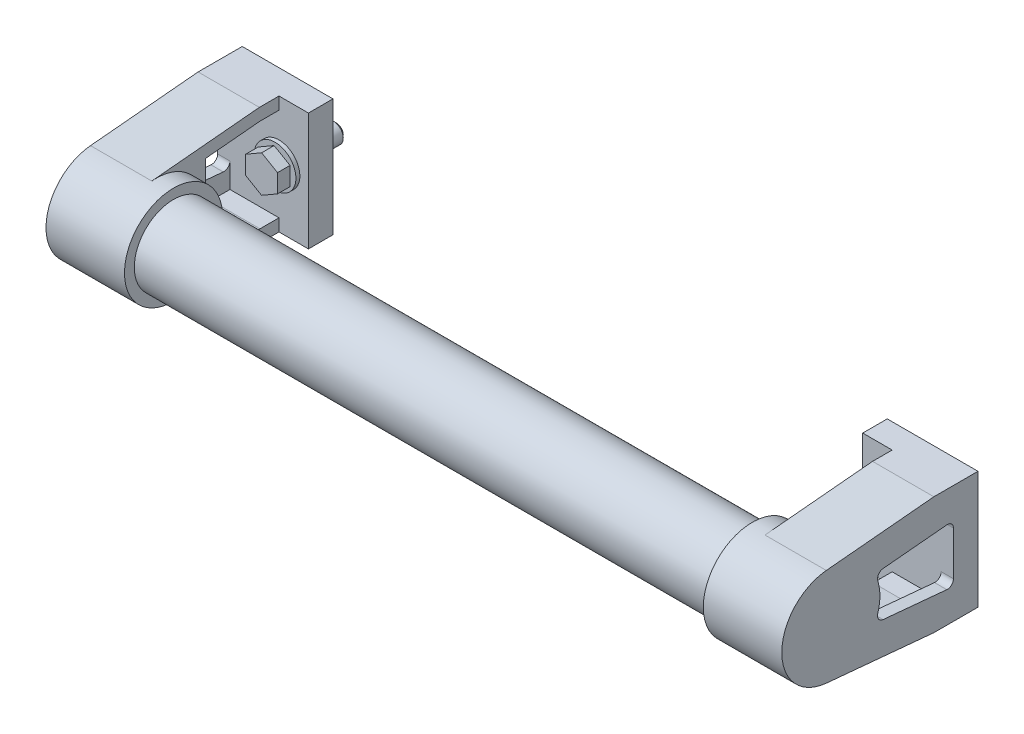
ISO-10303-21;
HEADER;
FILE_DESCRIPTION(('STEP AP214'),'2;1');
FILE_NAME('part.step','',(''),(''),'','','');
FILE_SCHEMA(('AUTOMOTIVE_DESIGN { 1 0 10303 214 1 1 1 1 }'));
ENDSEC;
DATA;
#1=APPLICATION_CONTEXT('core data for automotive mechanical design processes');
#2=APPLICATION_PROTOCOL_DEFINITION('international standard','automotive_design',2000,#1);
#3=PRODUCT_CONTEXT('',#1,'mechanical');
#4=PRODUCT('Part','Part','',(#3));
#5=PRODUCT_RELATED_PRODUCT_CATEGORY('part','',(#4));
#6=PRODUCT_DEFINITION_FORMATION('','',#4);
#7=PRODUCT_DEFINITION_CONTEXT('part definition',#1,'design');
#8=PRODUCT_DEFINITION('design','',#6,#7);
#9=PRODUCT_DEFINITION_SHAPE('','',#8);
#10=(LENGTH_UNIT() NAMED_UNIT(*) SI_UNIT(.MILLI.,.METRE.));
#11=(NAMED_UNIT(*) PLANE_ANGLE_UNIT() SI_UNIT($,.RADIAN.));
#12=(NAMED_UNIT(*) SI_UNIT($,.STERADIAN.) SOLID_ANGLE_UNIT());
#13=UNCERTAINTY_MEASURE_WITH_UNIT(LENGTH_MEASURE(1.E-05),#10,'distance_accuracy_value','');
#14=(GEOMETRIC_REPRESENTATION_CONTEXT(3) GLOBAL_UNCERTAINTY_ASSIGNED_CONTEXT((#13)) GLOBAL_UNIT_ASSIGNED_CONTEXT((#10,
#11,#12)) REPRESENTATION_CONTEXT('',''));
#15=CARTESIAN_POINT('',(0.,0.,0.));
#16=DIRECTION('',(0.,0.,1.));
#17=DIRECTION('',(1.,0.,0.));
#18=AXIS2_PLACEMENT_3D('',#15,#16,#17);
#19=CARTESIAN_POINT('',(250.,-1.91253263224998E-13,17.1));
#20=DIRECTION('',(0.,0.,1.));
#21=DIRECTION('',(0.,1.,0.));
#22=AXIS2_PLACEMENT_3D('',#19,#20,#21);
#23=PLANE('',#22);
#24=DIRECTION('',(0.866025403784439,-0.5,0.));
#25=VECTOR('',#24,1.);
#26=CARTESIAN_POINT('',(243.5,-3.75277674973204,17.1));
#27=LINE('',#26,#25);
#28=CARTESIAN_POINT('',(243.5,-3.75277674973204,17.1));
#29=VERTEX_POINT('',#28);
#30=CARTESIAN_POINT('',(250.,-7.50555349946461,17.1));
#31=VERTEX_POINT('',#30);
#32=EDGE_CURVE('E537',#29,#31,#27,.T.);
#33=ORIENTED_EDGE('',*,*,#32,.T.);
#34=DIRECTION('',(0.866025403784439,0.5,0.));
#35=VECTOR('',#34,1.);
#36=CARTESIAN_POINT('',(250.,-7.50555349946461,17.1));
#37=LINE('',#36,#35);
#38=CARTESIAN_POINT('',(256.5,-3.75277674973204,17.1));
#39=VERTEX_POINT('',#38);
#40=EDGE_CURVE('E541',#31,#39,#37,.T.);
#41=ORIENTED_EDGE('',*,*,#40,.T.);
#42=DIRECTION('',(0.,1.,0.));
#43=VECTOR('',#42,1.);
#44=CARTESIAN_POINT('',(256.5,-3.75277674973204,17.1));
#45=LINE('',#44,#43);
#46=CARTESIAN_POINT('',(256.5,3.7527767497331,17.1));
#47=VERTEX_POINT('',#46);
#48=EDGE_CURVE('E548',#39,#47,#45,.T.);
#49=ORIENTED_EDGE('',*,*,#48,.T.);
#50=DIRECTION('',(-0.866025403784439,0.5,0.));
#51=VECTOR('',#50,1.);
#52=CARTESIAN_POINT('',(256.5,3.7527767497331,17.1));
#53=LINE('',#52,#51);
#54=CARTESIAN_POINT('',(250.,7.50555349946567,17.1));
#55=VERTEX_POINT('',#54);
#56=EDGE_CURVE('E556',#47,#55,#53,.T.);
#57=ORIENTED_EDGE('',*,*,#56,.T.);
#58=DIRECTION('',(-0.866025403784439,-0.5,0.));
#59=VECTOR('',#58,1.);
#60=CARTESIAN_POINT('',(250.,7.50555349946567,17.1));
#61=LINE('',#60,#59);
#62=CARTESIAN_POINT('',(243.5,3.7527767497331,17.1));
#63=VERTEX_POINT('',#62);
#64=EDGE_CURVE('E559',#55,#63,#61,.T.);
#65=ORIENTED_EDGE('',*,*,#64,.T.);
#66=DIRECTION('',(0.,-1.,0.));
#67=VECTOR('',#66,1.);
#68=CARTESIAN_POINT('',(243.5,3.7527767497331,17.1));
#69=LINE('',#68,#67);
#70=EDGE_CURVE('E562',#63,#29,#69,.T.);
#71=ORIENTED_EDGE('',*,*,#70,.T.);
#72=EDGE_LOOP('',(#33,#41,#49,#57,#65,#71));
#73=FACE_BOUND('',#72,.T.);
#74=ADVANCED_FACE('F14',(#73),#23,.T.);
#75=CARTESIAN_POINT('',(243.5,3.7527767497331,12.));
#76=DIRECTION('',(-1.,0.,0.));
#77=DIRECTION('',(0.,0.,-1.));
#78=AXIS2_PLACEMENT_3D('',#75,#76,#77);
#79=PLANE('',#78);
#80=DIRECTION('',(0.,-1.,0.));
#81=VECTOR('',#80,1.);
#82=CARTESIAN_POINT('',(243.5,3.7527767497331,12.));
#83=LINE('',#82,#81);
#84=CARTESIAN_POINT('',(243.5,3.7527767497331,12.));
#85=VERTEX_POINT('',#84);
#86=CARTESIAN_POINT('',(243.5,-3.75277674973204,12.));
#87=VERTEX_POINT('',#86);
#88=EDGE_CURVE('E551',#85,#87,#83,.T.);
#89=ORIENTED_EDGE('',*,*,#88,.T.);
#90=DIRECTION('',(0.,0.,1.));
#91=VECTOR('',#90,1.);
#92=CARTESIAN_POINT('',(243.5,-3.75277674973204,12.));
#93=LINE('',#92,#91);
#94=EDGE_CURVE('E565',#87,#29,#93,.T.);
#95=ORIENTED_EDGE('',*,*,#94,.T.);
#96=ORIENTED_EDGE('',*,*,#70,.F.);
#97=DIRECTION('',(0.,0.,1.));
#98=VECTOR('',#97,1.);
#99=CARTESIAN_POINT('',(243.5,3.7527767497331,12.));
#100=LINE('',#99,#98);
#101=EDGE_CURVE('E569',#85,#63,#100,.T.);
#102=ORIENTED_EDGE('',*,*,#101,.F.);
#103=EDGE_LOOP('',(#89,#95,#96,#102));
#104=FACE_BOUND('',#103,.T.);
#105=ADVANCED_FACE('F1108',(#104),#79,.T.);
#106=CARTESIAN_POINT('',(243.5,-3.75277674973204,12.));
#107=DIRECTION('',(-0.5,-0.866025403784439,0.));
#108=DIRECTION('',(0.866025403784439,-0.5,0.));
#109=AXIS2_PLACEMENT_3D('',#106,#107,#108);
#110=PLANE('',#109);
#111=ORIENTED_EDGE('',*,*,#32,.F.);
#112=ORIENTED_EDGE('',*,*,#94,.F.);
#113=DIRECTION('',(0.866025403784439,-0.5,0.));
#114=VECTOR('',#113,1.);
#115=CARTESIAN_POINT('',(243.5,-3.75277674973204,12.));
#116=LINE('',#115,#114);
#117=CARTESIAN_POINT('',(250.,-7.50555349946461,12.));
#118=VERTEX_POINT('',#117);
#119=EDGE_CURVE('E564',#87,#118,#116,.T.);
#120=ORIENTED_EDGE('',*,*,#119,.T.);
#121=DIRECTION('',(0.,0.,1.));
#122=VECTOR('',#121,1.);
#123=CARTESIAN_POINT('',(250.,-7.50555349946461,12.));
#124=LINE('',#123,#122);
#125=EDGE_CURVE('E581',#118,#31,#124,.T.);
#126=ORIENTED_EDGE('',*,*,#125,.T.);
#127=EDGE_LOOP('',(#111,#112,#120,#126));
#128=FACE_BOUND('',#127,.T.);
#129=ADVANCED_FACE('F1114',(#128),#110,.T.);
#130=CARTESIAN_POINT('',(250.,-7.50555349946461,12.));
#131=DIRECTION('',(0.5,-0.866025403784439,0.));
#132=DIRECTION('',(0.866025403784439,0.5,0.));
#133=AXIS2_PLACEMENT_3D('',#130,#131,#132);
#134=PLANE('',#133);
#135=ORIENTED_EDGE('',*,*,#40,.F.);
#136=ORIENTED_EDGE('',*,*,#125,.F.);
#137=DIRECTION('',(0.866025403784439,0.5,0.));
#138=VECTOR('',#137,1.);
#139=CARTESIAN_POINT('',(250.,-7.50555349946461,12.));
#140=LINE('',#139,#138);
#141=CARTESIAN_POINT('',(256.5,-3.75277674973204,12.));
#142=VERTEX_POINT('',#141);
#143=EDGE_CURVE('E1678',#118,#142,#140,.T.);
#144=ORIENTED_EDGE('',*,*,#143,.T.);
#145=DIRECTION('',(0.,0.,1.));
#146=VECTOR('',#145,1.);
#147=CARTESIAN_POINT('',(256.5,-3.75277674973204,12.));
#148=LINE('',#147,#146);
#149=EDGE_CURVE('E578',#142,#39,#148,.T.);
#150=ORIENTED_EDGE('',*,*,#149,.T.);
#151=EDGE_LOOP('',(#135,#136,#144,#150));
#152=FACE_BOUND('',#151,.T.);
#153=ADVANCED_FACE('F1803',(#152),#134,.T.);
#154=CARTESIAN_POINT('',(256.5,-3.75277674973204,12.));
#155=DIRECTION('',(1.,0.,0.));
#156=DIRECTION('',(0.,0.,1.));
#157=AXIS2_PLACEMENT_3D('',#154,#155,#156);
#158=PLANE('',#157);
#159=DIRECTION('',(0.,1.,0.));
#160=VECTOR('',#159,1.);
#161=CARTESIAN_POINT('',(256.5,-3.75277674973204,12.));
#162=LINE('',#161,#160);
#163=CARTESIAN_POINT('',(256.5,3.7527767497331,12.));
#164=VERTEX_POINT('',#163);
#165=EDGE_CURVE('E1673',#142,#164,#162,.T.);
#166=ORIENTED_EDGE('',*,*,#165,.T.);
#167=DIRECTION('',(0.,0.,1.));
#168=VECTOR('',#167,1.);
#169=CARTESIAN_POINT('',(256.5,3.7527767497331,12.));
#170=LINE('',#169,#168);
#171=EDGE_CURVE('E575',#164,#47,#170,.T.);
#172=ORIENTED_EDGE('',*,*,#171,.T.);
#173=ORIENTED_EDGE('',*,*,#48,.F.);
#174=ORIENTED_EDGE('',*,*,#149,.F.);
#175=EDGE_LOOP('',(#166,#172,#173,#174));
#176=FACE_BOUND('',#175,.T.);
#177=ADVANCED_FACE('F1797',(#176),#158,.T.);
#178=CARTESIAN_POINT('',(256.5,3.7527767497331,12.));
#179=DIRECTION('',(0.5,0.866025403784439,0.));
#180=DIRECTION('',(-0.866025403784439,0.5,0.));
#181=AXIS2_PLACEMENT_3D('',#178,#179,#180);
#182=PLANE('',#181);
#183=DIRECTION('',(-0.866025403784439,0.5,0.));
#184=VECTOR('',#183,1.);
#185=CARTESIAN_POINT('',(256.5,3.7527767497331,12.));
#186=LINE('',#185,#184);
#187=CARTESIAN_POINT('',(250.,7.50555349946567,12.));
#188=VERTEX_POINT('',#187);
#189=EDGE_CURVE('E1666',#164,#188,#186,.T.);
#190=ORIENTED_EDGE('',*,*,#189,.T.);
#191=DIRECTION('',(0.,0.,1.));
#192=VECTOR('',#191,1.);
#193=CARTESIAN_POINT('',(250.,7.50555349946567,12.));
#194=LINE('',#193,#192);
#195=EDGE_CURVE('E572',#188,#55,#194,.T.);
#196=ORIENTED_EDGE('',*,*,#195,.T.);
#197=ORIENTED_EDGE('',*,*,#56,.F.);
#198=ORIENTED_EDGE('',*,*,#171,.F.);
#199=EDGE_LOOP('',(#190,#196,#197,#198));
#200=FACE_BOUND('',#199,.T.);
#201=ADVANCED_FACE('F1652',(#200),#182,.T.);
#202=CARTESIAN_POINT('',(250.,7.50555349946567,12.));
#203=DIRECTION('',(-0.5,0.866025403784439,0.));
#204=DIRECTION('',(-0.866025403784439,-0.5,0.));
#205=AXIS2_PLACEMENT_3D('',#202,#203,#204);
#206=PLANE('',#205);
#207=DIRECTION('',(-0.866025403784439,-0.5,0.));
#208=VECTOR('',#207,1.);
#209=CARTESIAN_POINT('',(250.,7.50555349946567,12.));
#210=LINE('',#209,#208);
#211=EDGE_CURVE('E1662',#188,#85,#210,.T.);
#212=ORIENTED_EDGE('',*,*,#211,.T.);
#213=ORIENTED_EDGE('',*,*,#101,.T.);
#214=ORIENTED_EDGE('',*,*,#64,.F.);
#215=ORIENTED_EDGE('',*,*,#195,.F.);
#216=EDGE_LOOP('',(#212,#213,#214,#215));
#217=FACE_BOUND('',#216,.T.);
#218=ADVANCED_FACE('F1640',(#217),#206,.T.);
#219=CARTESIAN_POINT('',(256.5,0.,12.));
#220=DIRECTION('',(0.,0.,-1.));
#221=DIRECTION('',(0.,-1.,0.));
#222=AXIS2_PLACEMENT_3D('',#219,#220,#221);
#223=PLANE('',#222);
#224=CARTESIAN_POINT('',(250.,0.,12.));
#225=DIRECTION('',(0.,0.,1.));
#226=DIRECTION('',(0.,1.,0.));
#227=AXIS2_PLACEMENT_3D('',#224,#225,#226);
#228=CIRCLE('',#227,5.85000000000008);
#229=CARTESIAN_POINT('',(250.,5.85000000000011,12.0000000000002));
#230=VERTEX_POINT('',#229);
#231=EDGE_CURVE('E568',#230,#230,#228,.F.);
#232=ORIENTED_EDGE('',*,*,#231,.F.);
#233=EDGE_LOOP('',(#232));
#234=FACE_BOUND('',#233,.T.);
#235=ORIENTED_EDGE('',*,*,#211,.F.);
#236=ORIENTED_EDGE('',*,*,#189,.F.);
#237=ORIENTED_EDGE('',*,*,#165,.F.);
#238=ORIENTED_EDGE('',*,*,#143,.F.);
#239=ORIENTED_EDGE('',*,*,#119,.F.);
#240=ORIENTED_EDGE('',*,*,#88,.F.);
#241=EDGE_LOOP('',(#235,#236,#237,#238,#239,#240));
#242=FACE_BOUND('',#241,.T.);
#243=ADVANCED_FACE('F1119',(#234,#242),#223,.T.);
#244=CARTESIAN_POINT('',(250.,1.08550321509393E-12,-13.4));
#245=DIRECTION('',(0.,0.,1.));
#246=DIRECTION('',(0.,1.,0.));
#247=AXIS2_PLACEMENT_3D('',#244,#245,#246);
#248=PLANE('',#247);
#249=CARTESIAN_POINT('',(250.,1.09099607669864E-12,-13.4));
#250=DIRECTION('',(0.,0.,1.));
#251=DIRECTION('',(0.,1.,0.));
#252=AXIS2_PLACEMENT_3D('',#249,#250,#251);
#253=CIRCLE('',#252,2.79999999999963);
#254=CARTESIAN_POINT('',(250.,2.80000000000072,-13.3999999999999));
#255=VERTEX_POINT('',#254);
#256=EDGE_CURVE('E24',#255,#255,#253,.F.);
#257=ORIENTED_EDGE('',*,*,#256,.T.);
#258=EDGE_LOOP('',(#257));
#259=FACE_BOUND('',#258,.T.);
#260=ADVANCED_FACE('F1632',(#259),#248,.F.);
#261=CARTESIAN_POINT('',(250.,-2.80027737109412E-12,80.));
#262=DIRECTION('',(0.,0.,1.));
#263=DIRECTION('',(0.,1.,0.));
#264=AXIS2_PLACEMENT_3D('',#261,#262,#263);
#265=CYLINDRICAL_SURFACE('',#264,5.85000000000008);
#266=ORIENTED_EDGE('',*,*,#231,.T.);
#267=EDGE_LOOP('',(#266));
#268=FACE_BOUND('',#267,.T.);
#269=CARTESIAN_POINT('',(250.,0.,11.6));
#270=DIRECTION('',(0.,0.,1.));
#271=DIRECTION('',(0.,1.,0.));
#272=AXIS2_PLACEMENT_3D('',#269,#270,#271);
#273=CIRCLE('',#272,5.85000000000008);
#274=CARTESIAN_POINT('',(250.,5.85000000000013,11.6000000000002));
#275=VERTEX_POINT('',#274);
#276=EDGE_CURVE('E882',#275,#275,#273,.F.);
#277=ORIENTED_EDGE('',*,*,#276,.F.);
#278=EDGE_LOOP('',(#277));
#279=FACE_BOUND('',#278,.T.);
#280=ADVANCED_FACE('F1125',(#268,#279),#265,.T.);
#281=CARTESIAN_POINT('',(250.,1.04103604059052E-12,-12.2));
#282=DIRECTION('',(0.,0.,1.));
#283=DIRECTION('',(0.,1.,0.));
#284=AXIS2_PLACEMENT_3D('',#281,#282,#283);
#285=CONICAL_SURFACE('',#284,3.99999999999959,0.785398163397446);
#286=ORIENTED_EDGE('',*,*,#256,.F.);
#287=EDGE_LOOP('',(#286));
#288=FACE_BOUND('',#287,.T.);
#289=CARTESIAN_POINT('',(250.,1.04103604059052E-12,-12.2));
#290=DIRECTION('',(0.,0.,1.));
#291=DIRECTION('',(0.,1.,0.));
#292=AXIS2_PLACEMENT_3D('',#289,#290,#291);
#293=CIRCLE('',#292,3.99999999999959);
#294=CARTESIAN_POINT('',(250.,4.00000000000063,-12.1999999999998));
#295=VERTEX_POINT('',#294);
#296=EDGE_CURVE('E853',#295,#295,#293,.T.);
#297=ORIENTED_EDGE('',*,*,#296,.F.);
#298=EDGE_LOOP('',(#297));
#299=FACE_BOUND('',#298,.T.);
#300=ADVANCED_FACE('F1121',(#288,#299),#285,.T.);
#301=CARTESIAN_POINT('',(255.85,0.,11.6));
#302=DIRECTION('',(0.,0.,1.));
#303=DIRECTION('',(0.,1.,0.));
#304=AXIS2_PLACEMENT_3D('',#301,#302,#303);
#305=PLANE('',#304);
#306=CARTESIAN_POINT('',(250.,0.,11.6));
#307=DIRECTION('',(0.,0.,1.));
#308=DIRECTION('',(0.,1.,0.));
#309=AXIS2_PLACEMENT_3D('',#306,#307,#308);
#310=CIRCLE('',#309,8.50000000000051);
#311=CARTESIAN_POINT('',(250.,8.50000000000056,11.6000000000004));
#312=VERTEX_POINT('',#311);
#313=EDGE_CURVE('E829',#312,#312,#310,.F.);
#314=ORIENTED_EDGE('',*,*,#313,.F.);
#315=EDGE_LOOP('',(#314));
#316=FACE_BOUND('',#315,.T.);
#317=ORIENTED_EDGE('',*,*,#276,.T.);
#318=EDGE_LOOP('',(#317));
#319=FACE_BOUND('',#318,.T.);
#320=ADVANCED_FACE('F1124',(#316,#319),#305,.T.);
#321=CARTESIAN_POINT('',(250.,0.,12.7319341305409));
#322=DIRECTION('',(0.,0.,1.));
#323=DIRECTION('',(0.,1.,0.));
#324=AXIS2_PLACEMENT_3D('',#321,#322,#323);
#325=CYLINDRICAL_SURFACE('',#324,3.99999999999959);
#326=ORIENTED_EDGE('',*,*,#296,.T.);
#327=EDGE_LOOP('',(#326));
#328=FACE_BOUND('',#327,.T.);
#329=CARTESIAN_POINT('',(250.,5.33109006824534E-13,0.));
#330=DIRECTION('',(0.,0.,1.));
#331=DIRECTION('',(0.,1.,0.));
#332=AXIS2_PLACEMENT_3D('',#329,#330,#331);
#333=CIRCLE('',#332,3.99999999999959);
#334=CARTESIAN_POINT('',(250.,4.00000000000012,1.14491749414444E-13));
#335=VERTEX_POINT('',#334);
#336=EDGE_CURVE('E724',#335,#335,#333,.T.);
#337=ORIENTED_EDGE('',*,*,#336,.F.);
#338=EDGE_LOOP('',(#337));
#339=FACE_BOUND('',#338,.T.);
#340=ADVANCED_FACE('F1625',(#328,#339),#325,.T.);
#341=CARTESIAN_POINT('',(250.,-2.80027737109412E-12,80.));
#342=DIRECTION('',(0.,0.,1.));
#343=DIRECTION('',(0.,1.,0.));
#344=AXIS2_PLACEMENT_3D('',#341,#342,#343);
#345=CYLINDRICAL_SURFACE('',#344,8.50000000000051);
#346=ORIENTED_EDGE('',*,*,#313,.T.);
#347=EDGE_LOOP('',(#346));
#348=FACE_BOUND('',#347,.T.);
#349=CARTESIAN_POINT('',(250.,1.14058068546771E-13,10.));
#350=DIRECTION('',(0.,0.,1.));
#351=DIRECTION('',(0.,1.,0.));
#352=AXIS2_PLACEMENT_3D('',#349,#350,#351);
#353=CIRCLE('',#352,8.50000000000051);
#354=CARTESIAN_POINT('',(250.,8.50000000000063,10.0000000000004));
#355=VERTEX_POINT('',#354);
#356=EDGE_CURVE('E690',#355,#355,#353,.T.);
#357=ORIENTED_EDGE('',*,*,#356,.T.);
#358=EDGE_LOOP('',(#357));
#359=FACE_BOUND('',#358,.T.);
#360=ADVANCED_FACE('F1618',(#348,#359),#345,.T.);
#361=CARTESIAN_POINT('',(270.,18.9999999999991,40.0000000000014));
#362=DIRECTION('',(-1.,0.,0.));
#363=DIRECTION('',(0.,0.,-1.));
#364=AXIS2_PLACEMENT_3D('',#361,#362,#363);
#365=PLANE('',#364);
#366=DIRECTION('',(0.,-1.,0.));
#367=VECTOR('',#366,1.);
#368=CARTESIAN_POINT('',(270.,8.9453276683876,10.0000000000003));
#369=LINE('',#368,#367);
#370=CARTESIAN_POINT('',(270.,-8.94532766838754,9.99999999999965));
#371=VERTEX_POINT('',#370);
#372=CARTESIAN_POINT('',(270.,-19.,9.99999999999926));
#373=VERTEX_POINT('',#372);
#374=EDGE_CURVE('E687',#371,#373,#369,.T.);
#375=ORIENTED_EDGE('',*,*,#374,.T.);
#376=DIRECTION('',(0.,0.,-1.));
#377=VECTOR('',#376,1.);
#378=CARTESIAN_POINT('',(270.,-19.,9.99999999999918));
#379=LINE('',#378,#377);
#380=CARTESIAN_POINT('',(270.,-19.,17.7675646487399));
#381=VERTEX_POINT('',#380);
#382=EDGE_CURVE('E762',#381,#373,#379,.T.);
#383=ORIENTED_EDGE('',*,*,#382,.F.);
#384=DIRECTION('',(0.,-0.0927736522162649,-0.995687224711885));
#385=VECTOR('',#384,1.);
#386=CARTESIAN_POINT('',(270.,-19.,17.7675646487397));
#387=LINE('',#386,#385);
#388=CARTESIAN_POINT('',(270.,-16.9284817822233,40.));
#389=VERTEX_POINT('',#388);
#390=EDGE_CURVE('E763',#389,#381,#387,.T.);
#391=ORIENTED_EDGE('',*,*,#390,.F.);
#392=DIRECTION('',(0.,-1.,0.));
#393=VECTOR('',#392,1.);
#394=CARTESIAN_POINT('',(270.,23.9999999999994,40.0000000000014));
#395=LINE('',#394,#393);
#396=CARTESIAN_POINT('',(270.,-8.50076165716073,40.));
#397=VERTEX_POINT('',#396);
#398=EDGE_CURVE('E773',#397,#389,#395,.T.);
#399=ORIENTED_EDGE('',*,*,#398,.F.);
#400=CARTESIAN_POINT('',(270.,-6.5258254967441,38.4671506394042));
#401=DIRECTION('',(1.,0.,0.));
#402=DIRECTION('',(0.,0.,1.));
#403=AXIS2_PLACEMENT_3D('',#400,#401,#402);
#404=CIRCLE('',#403,2.5);
#405=CARTESIAN_POINT('',(270.,-9.01504355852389,38.699084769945));
#406=VERTEX_POINT('',#405);
#407=EDGE_CURVE('E701',#397,#406,#404,.T.);
#408=ORIENTED_EDGE('',*,*,#407,.T.);
#409=DIRECTION('',(0.,0.0927736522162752,0.995687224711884));
#410=VECTOR('',#409,1.);
#411=CARTESIAN_POINT('',(270.,-11.4345457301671,12.7319341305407));
#412=LINE('',#411,#410);
#413=CARTESIAN_POINT('',(270.,-11.4345457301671,12.7319341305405));
#414=VERTEX_POINT('',#413);
#415=EDGE_CURVE('E705',#406,#414,#412,.F.);
#416=ORIENTED_EDGE('',*,*,#415,.T.);
#417=CARTESIAN_POINT('',(270.,-8.94532766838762,12.4999999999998));
#418=DIRECTION('',(1.,0.,0.));
#419=DIRECTION('',(0.,0.,1.));
#420=AXIS2_PLACEMENT_3D('',#417,#418,#419);
#421=CIRCLE('',#420,2.5);
#422=EDGE_CURVE('E723',#414,#371,#421,.T.);
#423=ORIENTED_EDGE('',*,*,#422,.T.);
#424=EDGE_LOOP('',(#375,#383,#391,#399,#408,#416,#423));
#425=FACE_BOUND('',#424,.T.);
#426=ADVANCED_FACE('F1615',(#425),#365,.T.);
#427=CARTESIAN_POINT('',(270.,18.9999999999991,40.0000000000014));
#428=DIRECTION('',(-1.,0.,0.));
#429=DIRECTION('',(0.,0.,-1.));
#430=AXIS2_PLACEMENT_3D('',#427,#428,#429);
#431=PLANE('',#430);
#432=DIRECTION('',(0.,-1.,0.));
#433=VECTOR('',#432,1.);
#434=CARTESIAN_POINT('',(270.,23.9999999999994,40.0000000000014));
#435=LINE('',#434,#433);
#436=CARTESIAN_POINT('',(270.,16.9284817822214,40.0000000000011));
#437=VERTEX_POINT('',#436);
#438=CARTESIAN_POINT('',(270.,8.50076165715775,40.0000000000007));
#439=VERTEX_POINT('',#438);
#440=EDGE_CURVE('E794',#437,#439,#435,.T.);
#441=ORIENTED_EDGE('',*,*,#440,.F.);
#442=DIRECTION('',(0.,0.0927736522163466,-0.995687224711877));
#443=VECTOR('',#442,1.);
#444=CARTESIAN_POINT('',(270.,19.,17.7675646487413));
#445=LINE('',#444,#443);
#446=CARTESIAN_POINT('',(270.,19.,17.7675646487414));
#447=VERTEX_POINT('',#446);
#448=EDGE_CURVE('E804',#437,#447,#445,.T.);
#449=ORIENTED_EDGE('',*,*,#448,.T.);
#450=DIRECTION('',(0.,0.,-1.));
#451=VECTOR('',#450,1.);
#452=CARTESIAN_POINT('',(270.,19.0000000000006,10.0000000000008));
#453=LINE('',#452,#451);
#454=CARTESIAN_POINT('',(270.,19.0000000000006,10.0000000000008));
#455=VERTEX_POINT('',#454);
#456=EDGE_CURVE('E826',#447,#455,#453,.T.);
#457=ORIENTED_EDGE('',*,*,#456,.T.);
#458=DIRECTION('',(0.,-1.,0.));
#459=VECTOR('',#458,1.);
#460=CARTESIAN_POINT('',(270.,8.9453276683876,10.0000000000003));
#461=LINE('',#460,#459);
#462=CARTESIAN_POINT('',(270.,8.94532766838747,10.0000000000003));
#463=VERTEX_POINT('',#462);
#464=EDGE_CURVE('E684',#455,#463,#461,.T.);
#465=ORIENTED_EDGE('',*,*,#464,.T.);
#466=CARTESIAN_POINT('',(270.,8.94532766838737,12.5000000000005));
#467=DIRECTION('',(1.,0.,0.));
#468=DIRECTION('',(0.,0.,1.));
#469=AXIS2_PLACEMENT_3D('',#466,#467,#468);
#470=CIRCLE('',#469,2.5);
#471=CARTESIAN_POINT('',(270.,11.434545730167,12.7319341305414));
#472=VERTEX_POINT('',#471);
#473=EDGE_CURVE('E691',#463,#472,#470,.T.);
#474=ORIENTED_EDGE('',*,*,#473,.T.);
#475=DIRECTION('',(0.,-0.0927736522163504,0.995687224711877));
#476=VECTOR('',#475,1.);
#477=CARTESIAN_POINT('',(270.,11.4345457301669,12.7319341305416));
#478=LINE('',#477,#476);
#479=CARTESIAN_POINT('',(270.,9.01504355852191,38.6990847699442));
#480=VERTEX_POINT('',#479);
#481=EDGE_CURVE('E695',#480,#472,#478,.F.);
#482=ORIENTED_EDGE('',*,*,#481,.F.);
#483=CARTESIAN_POINT('',(270.,6.52582549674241,38.4671506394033));
#484=DIRECTION('',(1.,0.,0.));
#485=DIRECTION('',(0.,0.,1.));
#486=AXIS2_PLACEMENT_3D('',#483,#484,#485);
#487=CIRCLE('',#486,2.5);
#488=EDGE_CURVE('E700',#480,#439,#487,.T.);
#489=ORIENTED_EDGE('',*,*,#488,.T.);
#490=EDGE_LOOP('',(#441,#449,#457,#465,#474,#482,#489));
#491=FACE_BOUND('',#490,.T.);
#492=ADVANCED_FACE('F1594',(#491),#431,.T.);
#493=CARTESIAN_POINT('',(238.,24.0000000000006,10.0000000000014));
#494=DIRECTION('',(-1.,0.,0.));
#495=DIRECTION('',(0.,0.,-1.));
#496=AXIS2_PLACEMENT_3D('',#493,#494,#495);
#497=PLANE('',#496);
#498=DIRECTION('',(0.,-1.,0.));
#499=VECTOR('',#498,1.);
#500=CARTESIAN_POINT('',(238.,24.0000000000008,9.47159017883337E-13));
#501=LINE('',#500,#499);
#502=CARTESIAN_POINT('',(238.,-23.9999999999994,-1.01423499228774E-12));
#503=VERTEX_POINT('',#502);
#504=CARTESIAN_POINT('',(238.,24.0000000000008,9.47159017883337E-13));
#505=VERTEX_POINT('',#504);
#506=EDGE_CURVE('E720',#503,#505,#501,.F.);
#507=ORIENTED_EDGE('',*,*,#506,.F.);
#508=DIRECTION('',(0.,0.,1.));
#509=VECTOR('',#508,1.);
#510=CARTESIAN_POINT('',(238.,-23.9999999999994,-1.05124242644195E-12));
#511=LINE('',#510,#509);
#512=CARTESIAN_POINT('',(238.,-24.,9.99999999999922));
#513=VERTEX_POINT('',#512);
#514=EDGE_CURVE('E708',#513,#503,#511,.F.);
#515=ORIENTED_EDGE('',*,*,#514,.F.);
#516=DIRECTION('',(0.,-1.,0.));
#517=VECTOR('',#516,1.);
#518=CARTESIAN_POINT('',(238.,8.9453276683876,10.0000000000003));
#519=LINE('',#518,#517);
#520=CARTESIAN_POINT('',(238.,24.0000000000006,10.0000000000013));
#521=VERTEX_POINT('',#520);
#522=EDGE_CURVE('E735',#513,#521,#519,.F.);
#523=ORIENTED_EDGE('',*,*,#522,.T.);
#524=DIRECTION('',(0.,0.,1.));
#525=VECTOR('',#524,1.);
#526=CARTESIAN_POINT('',(238.,24.0000000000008,9.47159017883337E-13));
#527=LINE('',#526,#525);
#528=EDGE_CURVE('E717',#521,#505,#527,.F.);
#529=ORIENTED_EDGE('',*,*,#528,.T.);
#530=EDGE_LOOP('',(#507,#515,#523,#529));
#531=FACE_BOUND('',#530,.T.);
#532=ADVANCED_FACE('F1590',(#531),#497,.T.);
#533=CARTESIAN_POINT('',(261.,-19.,9.99999999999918));
#534=DIRECTION('',(0.,1.,0.));
#535=DIRECTION('',(0.,0.,-1.));
#536=AXIS2_PLACEMENT_3D('',#533,#534,#535);
#537=PLANE('',#536);
#538=DIRECTION('',(-1.,0.,0.));
#539=VECTOR('',#538,1.);
#540=CARTESIAN_POINT('',(234.,-19.,9.99999999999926));
#541=LINE('',#540,#539);
#542=CARTESIAN_POINT('',(250.,-19.,9.99999999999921));
#543=VERTEX_POINT('',#542);
#544=EDGE_CURVE('E749',#373,#543,#541,.T.);
#545=ORIENTED_EDGE('',*,*,#544,.T.);
#546=DIRECTION('',(0.,0.,-1.));
#547=VECTOR('',#546,1.);
#548=CARTESIAN_POINT('',(250.,-19.,60.));
#549=LINE('',#548,#547);
#550=CARTESIAN_POINT('',(250.,-19.,17.7675646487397));
#551=VERTEX_POINT('',#550);
#552=EDGE_CURVE('E744',#551,#543,#549,.T.);
#553=ORIENTED_EDGE('',*,*,#552,.F.);
#554=DIRECTION('',(-1.,0.,0.));
#555=VECTOR('',#554,1.);
#556=CARTESIAN_POINT('',(261.,-19.,17.7675646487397));
#557=LINE('',#556,#555);
#558=EDGE_CURVE('E759',#551,#381,#557,.F.);
#559=ORIENTED_EDGE('',*,*,#558,.T.);
#560=ORIENTED_EDGE('',*,*,#382,.T.);
#561=EDGE_LOOP('',(#545,#553,#559,#560));
#562=FACE_BOUND('',#561,.T.);
#563=ADVANCED_FACE('F1593',(#562),#537,.T.);
#564=CARTESIAN_POINT('',(261.,-19.,17.7675646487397));
#565=DIRECTION('',(0.,0.995687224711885,-0.0927736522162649));
#566=DIRECTION('',(0.,-0.0927736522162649,-0.995687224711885));
#567=AXIS2_PLACEMENT_3D('',#564,#565,#566);
#568=PLANE('',#567);
#569=ORIENTED_EDGE('',*,*,#558,.F.);
#570=DIRECTION('',(0.,-0.0927736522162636,-0.995687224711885));
#571=VECTOR('',#570,1.);
#572=CARTESIAN_POINT('',(250.,-16.9284817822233,40.));
#573=LINE('',#572,#571);
#574=CARTESIAN_POINT('',(250.,-16.9284817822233,40.));
#575=VERTEX_POINT('',#574);
#576=EDGE_CURVE('E638',#575,#551,#573,.T.);
#577=ORIENTED_EDGE('',*,*,#576,.F.);
#578=DIRECTION('',(-1.,0.,0.));
#579=VECTOR('',#578,1.);
#580=CARTESIAN_POINT('',(261.,-16.9284817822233,40.));
#581=LINE('',#580,#579);
#582=EDGE_CURVE('E770',#575,#389,#581,.F.);
#583=ORIENTED_EDGE('',*,*,#582,.T.);
#584=ORIENTED_EDGE('',*,*,#390,.T.);
#585=EDGE_LOOP('',(#569,#577,#583,#584));
#586=FACE_BOUND('',#585,.T.);
#587=ADVANCED_FACE('F1598',(#586),#568,.T.);
#588=CARTESIAN_POINT('',(246.,23.9999999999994,40.0000000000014));
#589=DIRECTION('',(0.,0.,-1.));
#590=DIRECTION('',(0.,-1.,0.));
#591=AXIS2_PLACEMENT_3D('',#588,#589,#590);
#592=PLANE('',#591);
#593=DIRECTION('',(1.,0.,0.));
#594=VECTOR('',#593,1.);
#595=CARTESIAN_POINT('',(234.,-8.50076165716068,40.));
#596=LINE('',#595,#594);
#597=CARTESIAN_POINT('',(250.,-8.50076165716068,40.));
#598=VERTEX_POINT('',#597);
#599=EDGE_CURVE('E704',#598,#397,#596,.T.);
#600=ORIENTED_EDGE('',*,*,#599,.T.);
#601=ORIENTED_EDGE('',*,*,#398,.T.);
#602=ORIENTED_EDGE('',*,*,#582,.F.);
#603=DIRECTION('',(0.,-1.,0.));
#604=VECTOR('',#603,1.);
#605=CARTESIAN_POINT('',(250.,-2.09251019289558E-12,40.));
#606=LINE('',#605,#604);
#607=EDGE_CURVE('E635',#598,#575,#606,.T.);
#608=ORIENTED_EDGE('',*,*,#607,.F.);
#609=EDGE_LOOP('',(#600,#601,#602,#608));
#610=FACE_BOUND('',#609,.T.);
#611=ADVANCED_FACE('F1588',(#610),#592,.T.);
#612=CARTESIAN_POINT('',(234.,24.0000000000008,9.47159017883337E-13));
#613=DIRECTION('',(0.,0.,-1.));
#614=DIRECTION('',(0.,-1.,0.));
#615=AXIS2_PLACEMENT_3D('',#612,#613,#614);
#616=PLANE('',#615);
#617=DIRECTION('',(-1.,0.,0.));
#618=VECTOR('',#617,1.);
#619=CARTESIAN_POINT('',(234.,24.0000000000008,9.47159017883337E-13));
#620=LINE('',#619,#618);
#621=CARTESIAN_POINT('',(275.,24.0000000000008,-3.85108611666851E-13));
#622=VERTEX_POINT('',#621);
#623=EDGE_CURVE('E659',#505,#622,#620,.F.);
#624=ORIENTED_EDGE('',*,*,#623,.T.);
#625=DIRECTION('',(0.,-1.,0.));
#626=VECTOR('',#625,1.);
#627=CARTESIAN_POINT('',(275.,-2.09251019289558E-12,-1.05124242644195E-12));
#628=LINE('',#627,#626);
#629=CARTESIAN_POINT('',(275.,-24.,-1.05124242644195E-12));
#630=VERTEX_POINT('',#629);
#631=EDGE_CURVE('E615',#630,#622,#628,.F.);
#632=ORIENTED_EDGE('',*,*,#631,.F.);
#633=DIRECTION('',(-1.,0.,0.));
#634=VECTOR('',#633,1.);
#635=CARTESIAN_POINT('',(234.,-23.9999999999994,-1.05124242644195E-12));
#636=LINE('',#635,#634);
#637=EDGE_CURVE('E648',#503,#630,#636,.F.);
#638=ORIENTED_EDGE('',*,*,#637,.F.);
#639=ORIENTED_EDGE('',*,*,#506,.T.);
#640=EDGE_LOOP('',(#624,#632,#638,#639));
#641=FACE_BOUND('',#640,.T.);
#642=ORIENTED_EDGE('',*,*,#336,.T.);
#643=EDGE_LOOP('',(#642));
#644=FACE_BOUND('',#643,.T.);
#645=ADVANCED_FACE('F1547',(#641,#644),#616,.T.);
#646=CARTESIAN_POINT('',(234.,-23.9999999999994,-1.05124242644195E-12));
#647=DIRECTION('',(0.,-1.,0.));
#648=DIRECTION('',(0.,0.,1.));
#649=AXIS2_PLACEMENT_3D('',#646,#647,#648);
#650=PLANE('',#649);
#651=DIRECTION('',(0.,0.,1.));
#652=VECTOR('',#651,1.);
#653=CARTESIAN_POINT('',(275.,-24.0000000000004,60.));
#654=LINE('',#653,#652);
#655=CARTESIAN_POINT('',(275.,-24.0000000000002,17.999999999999));
#656=VERTEX_POINT('',#655);
#657=EDGE_CURVE('E612',#656,#630,#654,.F.);
#658=ORIENTED_EDGE('',*,*,#657,.F.);
#659=DIRECTION('',(-1.,0.,0.));
#660=VECTOR('',#659,1.);
#661=CARTESIAN_POINT('',(234.,-24.,17.999999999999));
#662=LINE('',#661,#660);
#663=CARTESIAN_POINT('',(250.,-24.0000000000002,17.999999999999));
#664=VERTEX_POINT('',#663);
#665=EDGE_CURVE('E595',#664,#656,#662,.F.);
#666=ORIENTED_EDGE('',*,*,#665,.F.);
#667=DIRECTION('',(0.,0.,1.));
#668=VECTOR('',#667,1.);
#669=CARTESIAN_POINT('',(250.,-23.9999999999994,-1.05124242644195E-12));
#670=LINE('',#669,#668);
#671=CARTESIAN_POINT('',(250.,-24.,9.99999999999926));
#672=VERTEX_POINT('',#671);
#673=EDGE_CURVE('E624',#664,#672,#670,.F.);
#674=ORIENTED_EDGE('',*,*,#673,.T.);
#675=DIRECTION('',(-1.,0.,0.));
#676=VECTOR('',#675,1.);
#677=CARTESIAN_POINT('',(234.,-24.,9.9999999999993));
#678=LINE('',#677,#676);
#679=EDGE_CURVE('E627',#672,#513,#678,.T.);
#680=ORIENTED_EDGE('',*,*,#679,.T.);
#681=ORIENTED_EDGE('',*,*,#514,.T.);
#682=ORIENTED_EDGE('',*,*,#637,.T.);
#683=EDGE_LOOP('',(#658,#666,#674,#680,#681,#682));
#684=FACE_BOUND('',#683,.T.);
#685=ADVANCED_FACE('F1543',(#684),#650,.T.);
#686=CARTESIAN_POINT('',(243.,-11.4345457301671,12.7319341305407));
#687=DIRECTION('',(0.,-0.995687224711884,0.0927736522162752));
#688=DIRECTION('',(0.,0.0927736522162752,0.995687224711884));
#689=AXIS2_PLACEMENT_3D('',#686,#687,#688);
#690=PLANE('',#689);
#691=DIRECTION('',(0.,0.0927736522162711,0.995687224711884));
#692=VECTOR('',#691,1.);
#693=CARTESIAN_POINT('',(275.,-11.4345457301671,12.7319341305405));
#694=LINE('',#693,#692);
#695=CARTESIAN_POINT('',(275.,-11.4345457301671,12.7319341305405));
#696=VERTEX_POINT('',#695);
#697=CARTESIAN_POINT('',(275.,-9.01504355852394,38.699084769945));
#698=VERTEX_POINT('',#697);
#699=EDGE_CURVE('E607',#696,#698,#694,.T.);
#700=ORIENTED_EDGE('',*,*,#699,.F.);
#701=DIRECTION('',(-1.,0.,0.));
#702=VECTOR('',#701,1.);
#703=CARTESIAN_POINT('',(243.,-11.4345457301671,12.7319341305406));
#704=LINE('',#703,#702);
#705=EDGE_CURVE('E702',#414,#696,#704,.F.);
#706=ORIENTED_EDGE('',*,*,#705,.F.);
#707=ORIENTED_EDGE('',*,*,#415,.F.);
#708=DIRECTION('',(1.,0.,0.));
#709=VECTOR('',#708,1.);
#710=CARTESIAN_POINT('',(234.,-9.01504355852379,38.6990847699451));
#711=LINE('',#710,#709);
#712=EDGE_CURVE('E697',#406,#698,#711,.T.);
#713=ORIENTED_EDGE('',*,*,#712,.T.);
#714=EDGE_LOOP('',(#700,#706,#707,#713));
#715=FACE_BOUND('',#714,.T.);
#716=ADVANCED_FACE('F1546',(#715),#690,.F.);
#717=CARTESIAN_POINT('',(243.,-8.94532766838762,12.4999999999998));
#718=DIRECTION('',(1.,0.,0.));
#719=DIRECTION('',(0.,0.,1.));
#720=AXIS2_PLACEMENT_3D('',#717,#718,#719);
#721=CYLINDRICAL_SURFACE('',#720,2.5);
#722=ORIENTED_EDGE('',*,*,#705,.T.);
#723=CARTESIAN_POINT('',(275.,-8.94532766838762,12.4999999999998));
#724=DIRECTION('',(1.,0.,0.));
#725=DIRECTION('',(0.,0.,1.));
#726=AXIS2_PLACEMENT_3D('',#723,#724,#725);
#727=CIRCLE('',#726,2.5);
#728=CARTESIAN_POINT('',(275.,-8.94532766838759,10.));
#729=VERTEX_POINT('',#728);
#730=EDGE_CURVE('E611',#729,#696,#727,.F.);
#731=ORIENTED_EDGE('',*,*,#730,.F.);
#732=DIRECTION('',(-1.,0.,0.));
#733=VECTOR('',#732,1.);
#734=CARTESIAN_POINT('',(234.,-8.94532766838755,9.99999999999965));
#735=LINE('',#734,#733);
#736=EDGE_CURVE('E683',#729,#371,#735,.T.);
#737=ORIENTED_EDGE('',*,*,#736,.T.);
#738=ORIENTED_EDGE('',*,*,#422,.F.);
#739=EDGE_LOOP('',(#722,#731,#737,#738));
#740=FACE_BOUND('',#739,.T.);
#741=ADVANCED_FACE('F1574',(#740),#721,.F.);
#742=CARTESIAN_POINT('',(243.,8.94532766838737,12.5000000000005));
#743=DIRECTION('',(1.,0.,0.));
#744=DIRECTION('',(0.,0.,1.));
#745=AXIS2_PLACEMENT_3D('',#742,#743,#744);
#746=CYLINDRICAL_SURFACE('',#745,2.5);
#747=CARTESIAN_POINT('',(275.,8.94532766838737,12.5000000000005));
#748=DIRECTION('',(1.,0.,0.));
#749=DIRECTION('',(0.,0.,1.));
#750=AXIS2_PLACEMENT_3D('',#747,#748,#749);
#751=CIRCLE('',#750,2.5);
#752=CARTESIAN_POINT('',(275.,11.434545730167,12.7319341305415));
#753=VERTEX_POINT('',#752);
#754=CARTESIAN_POINT('',(275.,8.94532766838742,10.0000000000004));
#755=VERTEX_POINT('',#754);
#756=EDGE_CURVE('E602',#753,#755,#751,.F.);
#757=ORIENTED_EDGE('',*,*,#756,.F.);
#758=DIRECTION('',(1.,0.,0.));
#759=VECTOR('',#758,1.);
#760=CARTESIAN_POINT('',(243.,11.434545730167,12.7319341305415));
#761=LINE('',#760,#759);
#762=EDGE_CURVE('E688',#472,#753,#761,.T.);
#763=ORIENTED_EDGE('',*,*,#762,.F.);
#764=ORIENTED_EDGE('',*,*,#473,.F.);
#765=DIRECTION('',(-1.,0.,0.));
#766=VECTOR('',#765,1.);
#767=CARTESIAN_POINT('',(234.,8.94532766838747,10.0000000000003));
#768=LINE('',#767,#766);
#769=EDGE_CURVE('E681',#463,#755,#768,.F.);
#770=ORIENTED_EDGE('',*,*,#769,.T.);
#771=EDGE_LOOP('',(#757,#763,#764,#770));
#772=FACE_BOUND('',#771,.T.);
#773=ADVANCED_FACE('F1570',(#772),#746,.F.);
#774=CARTESIAN_POINT('',(243.,11.4345457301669,12.7319341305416));
#775=DIRECTION('',(0.,-0.995687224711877,-0.0927736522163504));
#776=DIRECTION('',(0.,-0.0927736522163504,0.995687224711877));
#777=AXIS2_PLACEMENT_3D('',#774,#775,#776);
#778=PLANE('',#777);
#779=ORIENTED_EDGE('',*,*,#762,.T.);
#780=DIRECTION('',(0.,0.0927736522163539,-0.995687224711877));
#781=VECTOR('',#780,1.);
#782=CARTESIAN_POINT('',(275.,9.01504355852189,38.6990847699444));
#783=LINE('',#782,#781);
#784=CARTESIAN_POINT('',(275.,9.01504355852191,38.6990847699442));
#785=VERTEX_POINT('',#784);
#786=EDGE_CURVE('E603',#785,#753,#783,.T.);
#787=ORIENTED_EDGE('',*,*,#786,.F.);
#788=DIRECTION('',(-1.,0.,0.));
#789=VECTOR('',#788,1.);
#790=CARTESIAN_POINT('',(243.,9.01504355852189,38.6990847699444));
#791=LINE('',#790,#789);
#792=EDGE_CURVE('E692',#785,#480,#791,.T.);
#793=ORIENTED_EDGE('',*,*,#792,.T.);
#794=ORIENTED_EDGE('',*,*,#481,.T.);
#795=EDGE_LOOP('',(#779,#787,#793,#794));
#796=FACE_BOUND('',#795,.T.);
#797=ADVANCED_FACE('F1573',(#796),#778,.T.);
#798=CARTESIAN_POINT('',(261.,19.,17.7675646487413));
#799=DIRECTION('',(0.,0.995687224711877,0.0927736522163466));
#800=DIRECTION('',(0.,0.0927736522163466,-0.995687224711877));
#801=AXIS2_PLACEMENT_3D('',#798,#799,#800);
#802=PLANE('',#801);
#803=ORIENTED_EDGE('',*,*,#448,.F.);
#804=DIRECTION('',(-1.,0.,0.));
#805=VECTOR('',#804,1.);
#806=CARTESIAN_POINT('',(246.,16.9284817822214,40.0000000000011));
#807=LINE('',#806,#805);
#808=CARTESIAN_POINT('',(250.,16.9284817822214,40.0000000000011));
#809=VERTEX_POINT('',#808);
#810=EDGE_CURVE('E791',#809,#437,#807,.F.);
#811=ORIENTED_EDGE('',*,*,#810,.F.);
#812=DIRECTION('',(0.,-0.0927736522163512,0.995687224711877));
#813=VECTOR('',#812,1.);
#814=CARTESIAN_POINT('',(250.,19.0000000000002,17.7675646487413));
#815=LINE('',#814,#813);
#816=CARTESIAN_POINT('',(250.,19.0000000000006,17.7675646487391));
#817=VERTEX_POINT('',#816);
#818=EDGE_CURVE('E671',#817,#809,#815,.T.);
#819=ORIENTED_EDGE('',*,*,#818,.F.);
#820=DIRECTION('',(-1.,0.,0.));
#821=VECTOR('',#820,1.);
#822=CARTESIAN_POINT('',(261.,19.,17.7675646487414));
#823=LINE('',#822,#821);
#824=EDGE_CURVE('E795',#447,#817,#823,.T.);
#825=ORIENTED_EDGE('',*,*,#824,.F.);
#826=EDGE_LOOP('',(#803,#811,#819,#825));
#827=FACE_BOUND('',#826,.T.);
#828=ADVANCED_FACE('F1578',(#827),#802,.F.);
#829=CARTESIAN_POINT('',(261.,19.0000000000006,10.0000000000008));
#830=DIRECTION('',(0.,1.,0.));
#831=DIRECTION('',(0.,0.,-1.));
#832=AXIS2_PLACEMENT_3D('',#829,#830,#831);
#833=PLANE('',#832);
#834=ORIENTED_EDGE('',*,*,#456,.F.);
#835=ORIENTED_EDGE('',*,*,#824,.T.);
#836=DIRECTION('',(0.,0.,-1.));
#837=VECTOR('',#836,1.);
#838=CARTESIAN_POINT('',(250.,19.0000000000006,38.4671506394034));
#839=LINE('',#838,#837);
#840=CARTESIAN_POINT('',(250.,19.0000000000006,10.0000000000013));
#841=VERTEX_POINT('',#840);
#842=EDGE_CURVE('E778',#841,#817,#839,.F.);
#843=ORIENTED_EDGE('',*,*,#842,.F.);
#844=DIRECTION('',(-1.,0.,0.));
#845=VECTOR('',#844,1.);
#846=CARTESIAN_POINT('',(234.,19.0000000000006,10.0000000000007));
#847=LINE('',#846,#845);
#848=EDGE_CURVE('E738',#841,#455,#847,.F.);
#849=ORIENTED_EDGE('',*,*,#848,.T.);
#850=EDGE_LOOP('',(#834,#835,#843,#849));
#851=FACE_BOUND('',#850,.T.);
#852=ADVANCED_FACE('F1568',(#851),#833,.F.);
#853=CARTESIAN_POINT('',(234.,8.9453276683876,10.0000000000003));
#854=DIRECTION('',(0.,0.,-1.));
#855=DIRECTION('',(0.,-1.,0.));
#856=AXIS2_PLACEMENT_3D('',#853,#854,#855);
#857=PLANE('',#856);
#858=ORIENTED_EDGE('',*,*,#544,.F.);
#859=ORIENTED_EDGE('',*,*,#374,.F.);
#860=ORIENTED_EDGE('',*,*,#736,.F.);
#861=DIRECTION('',(0.,-1.,0.));
#862=VECTOR('',#861,1.);
#863=CARTESIAN_POINT('',(275.,-2.09251019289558E-12,10.0000000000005));
#864=LINE('',#863,#862);
#865=EDGE_CURVE('E598',#755,#729,#864,.T.);
#866=ORIENTED_EDGE('',*,*,#865,.F.);
#867=ORIENTED_EDGE('',*,*,#769,.F.);
#868=ORIENTED_EDGE('',*,*,#464,.F.);
#869=ORIENTED_EDGE('',*,*,#848,.F.);
#870=DIRECTION('',(0.,-1.,0.));
#871=VECTOR('',#870,1.);
#872=CARTESIAN_POINT('',(250.,6.52582549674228,10.0000000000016));
#873=LINE('',#872,#871);
#874=CARTESIAN_POINT('',(250.,24.0000000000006,10.0000000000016));
#875=VERTEX_POINT('',#874);
#876=EDGE_CURVE('E752',#875,#841,#873,.T.);
#877=ORIENTED_EDGE('',*,*,#876,.F.);
#878=DIRECTION('',(-1.,0.,0.));
#879=VECTOR('',#878,1.);
#880=CARTESIAN_POINT('',(234.,24.0000000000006,10.0000000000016));
#881=LINE('',#880,#879);
#882=EDGE_CURVE('E639',#875,#521,#881,.T.);
#883=ORIENTED_EDGE('',*,*,#882,.T.);
#884=ORIENTED_EDGE('',*,*,#522,.F.);
#885=ORIENTED_EDGE('',*,*,#679,.F.);
#886=DIRECTION('',(0.,-1.,0.));
#887=VECTOR('',#886,1.);
#888=CARTESIAN_POINT('',(250.,-2.09251019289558E-12,9.99999999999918));
#889=LINE('',#888,#887);
#890=EDGE_CURVE('E741',#543,#672,#889,.T.);
#891=ORIENTED_EDGE('',*,*,#890,.F.);
#892=EDGE_LOOP('',(#858,#859,#860,#866,#867,#868,#869,#877,#883,#884,#885,#891));
#893=FACE_BOUND('',#892,.T.);
#894=ORIENTED_EDGE('',*,*,#356,.F.);
#895=EDGE_LOOP('',(#894));
#896=FACE_BOUND('',#895,.T.);
#897=ADVANCED_FACE('F1565',(#893,#896),#857,.F.);
#898=CARTESIAN_POINT('',(246.,23.9999999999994,40.0000000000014));
#899=DIRECTION('',(0.,0.,-1.));
#900=DIRECTION('',(0.,-1.,0.));
#901=AXIS2_PLACEMENT_3D('',#898,#899,#900);
#902=PLANE('',#901);
#903=ORIENTED_EDGE('',*,*,#810,.T.);
#904=ORIENTED_EDGE('',*,*,#440,.T.);
#905=DIRECTION('',(1.,0.,0.));
#906=VECTOR('',#905,1.);
#907=CARTESIAN_POINT('',(234.,8.50076165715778,40.0000000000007));
#908=LINE('',#907,#906);
#909=CARTESIAN_POINT('',(250.,8.50076165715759,40.0000000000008));
#910=VERTEX_POINT('',#909);
#911=EDGE_CURVE('E696',#439,#910,#908,.F.);
#912=ORIENTED_EDGE('',*,*,#911,.T.);
#913=DIRECTION('',(0.,-1.,0.));
#914=VECTOR('',#913,1.);
#915=CARTESIAN_POINT('',(250.,6.52582549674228,40.0000000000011));
#916=LINE('',#915,#914);
#917=EDGE_CURVE('E667',#809,#910,#916,.T.);
#918=ORIENTED_EDGE('',*,*,#917,.F.);
#919=EDGE_LOOP('',(#903,#904,#912,#918));
#920=FACE_BOUND('',#919,.T.);
#921=ADVANCED_FACE('F1554',(#920),#902,.T.);
#922=CARTESIAN_POINT('',(234.,24.0000000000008,9.47159017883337E-13));
#923=DIRECTION('',(0.,-1.,0.));
#924=DIRECTION('',(0.,0.,1.));
#925=AXIS2_PLACEMENT_3D('',#922,#923,#924);
#926=PLANE('',#925);
#927=DIRECTION('',(0.,0.,1.));
#928=VECTOR('',#927,1.);
#929=CARTESIAN_POINT('',(250.,24.0000000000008,9.47159017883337E-13));
#930=LINE('',#929,#928);
#931=CARTESIAN_POINT('',(250.,24.0000000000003,17.999999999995));
#932=VERTEX_POINT('',#931);
#933=EDGE_CURVE('E656',#932,#875,#930,.F.);
#934=ORIENTED_EDGE('',*,*,#933,.F.);
#935=DIRECTION('',(-1.,0.,0.));
#936=VECTOR('',#935,1.);
#937=CARTESIAN_POINT('',(234.,24.0000000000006,17.999999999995));
#938=LINE('',#937,#936);
#939=CARTESIAN_POINT('',(275.,24.0000000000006,17.999999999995));
#940=VERTEX_POINT('',#939);
#941=EDGE_CURVE('E643',#932,#940,#938,.F.);
#942=ORIENTED_EDGE('',*,*,#941,.T.);
#943=DIRECTION('',(0.,0.,1.));
#944=VECTOR('',#943,1.);
#945=CARTESIAN_POINT('',(275.,24.0000000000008,60.));
#946=LINE('',#945,#944);
#947=EDGE_CURVE('E616',#622,#940,#946,.T.);
#948=ORIENTED_EDGE('',*,*,#947,.F.);
#949=ORIENTED_EDGE('',*,*,#623,.F.);
#950=ORIENTED_EDGE('',*,*,#528,.F.);
#951=ORIENTED_EDGE('',*,*,#882,.F.);
#952=EDGE_LOOP('',(#934,#942,#948,#949,#950,#951));
#953=FACE_BOUND('',#952,.T.);
#954=ADVANCED_FACE('F1530',(#953),#926,.F.);
#955=CARTESIAN_POINT('',(234.,-24.,17.999999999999));
#956=DIRECTION('',(0.,-0.995687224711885,0.092773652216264));
#957=DIRECTION('',(0.,0.092773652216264,0.995687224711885));
#958=AXIS2_PLACEMENT_3D('',#955,#956,#957);
#959=PLANE('',#958);
#960=DIRECTION('',(-1.,0.,0.));
#961=VECTOR('',#960,1.);
#962=CARTESIAN_POINT('',(234.,-19.9137444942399,61.8554730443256));
#963=LINE('',#962,#961);
#964=CARTESIAN_POINT('',(275.,-19.9137444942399,61.8554730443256));
#965=VERTEX_POINT('',#964);
#966=CARTESIAN_POINT('',(250.,-19.9137444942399,61.8554730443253));
#967=VERTEX_POINT('',#966);
#968=EDGE_CURVE('E584',#965,#967,#963,.T.);
#969=ORIENTED_EDGE('',*,*,#968,.T.);
#970=DIRECTION('',(0.,0.092773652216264,0.995687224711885));
#971=VECTOR('',#970,1.);
#972=CARTESIAN_POINT('',(250.,-24.,17.999999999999));
#973=LINE('',#972,#971);
#974=EDGE_CURVE('E621',#967,#664,#973,.F.);
#975=ORIENTED_EDGE('',*,*,#974,.T.);
#976=ORIENTED_EDGE('',*,*,#665,.T.);
#977=DIRECTION('',(0.,0.092773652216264,0.995687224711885));
#978=VECTOR('',#977,1.);
#979=CARTESIAN_POINT('',(275.,-24.,17.999999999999));
#980=LINE('',#979,#978);
#981=EDGE_CURVE('E588',#656,#965,#980,.T.);
#982=ORIENTED_EDGE('',*,*,#981,.T.);
#983=EDGE_LOOP('',(#969,#975,#976,#982));
#984=FACE_BOUND('',#983,.T.);
#985=ADVANCED_FACE('F1527',(#984),#959,.T.);
#986=CARTESIAN_POINT('',(250.,-2.09251019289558E-12,60.));
#987=DIRECTION('',(-1.,0.,0.));
#988=DIRECTION('',(0.,0.,-1.));
#989=AXIS2_PLACEMENT_3D('',#986,#987,#988);
#990=PLANE('',#989);
#991=ORIENTED_EDGE('',*,*,#673,.F.);
#992=ORIENTED_EDGE('',*,*,#974,.F.);
#993=CARTESIAN_POINT('',(250.,-2.09251019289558E-12,60.));
#994=DIRECTION('',(1.,0.,0.));
#995=DIRECTION('',(0.,0.,1.));
#996=AXIS2_PLACEMENT_3D('',#993,#994,#995);
#997=CIRCLE('',#996,20.0000000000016);
#998=CARTESIAN_POINT('',(250.,-5.80073377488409,40.8596894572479));
#999=VERTEX_POINT('',#998);
#1000=EDGE_CURVE('E680',#999,#967,#997,.F.);
#1001=ORIENTED_EDGE('',*,*,#1000,.F.);
#1002=CARTESIAN_POINT('',(250.,-6.5258254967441,38.4671506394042));
#1003=DIRECTION('',(1.,0.,0.));
#1004=DIRECTION('',(0.,0.,1.));
#1005=AXIS2_PLACEMENT_3D('',#1002,#1003,#1004);
#1006=CIRCLE('',#1005,2.5);
#1007=EDGE_CURVE('E628',#999,#598,#1006,.T.);
#1008=ORIENTED_EDGE('',*,*,#1007,.T.);
#1009=ORIENTED_EDGE('',*,*,#607,.T.);
#1010=ORIENTED_EDGE('',*,*,#576,.T.);
#1011=ORIENTED_EDGE('',*,*,#552,.T.);
#1012=ORIENTED_EDGE('',*,*,#890,.T.);
#1013=EDGE_LOOP('',(#991,#992,#1001,#1008,#1009,#1010,#1011,#1012));
#1014=FACE_BOUND('',#1013,.T.);
#1015=ADVANCED_FACE('F1529',(#1014),#990,.T.);
#1016=CARTESIAN_POINT('',(234.,-6.5258254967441,38.4671506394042));
#1017=DIRECTION('',(1.,0.,0.));
#1018=DIRECTION('',(0.,0.,1.));
#1019=AXIS2_PLACEMENT_3D('',#1016,#1017,#1018);
#1020=CYLINDRICAL_SURFACE('',#1019,2.5);
#1021=ORIENTED_EDGE('',*,*,#1007,.F.);
#1022=DIRECTION('',(1.,0.,0.));
#1023=VECTOR('',#1022,1.);
#1024=CARTESIAN_POINT('',(243.,-5.80073377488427,40.8596894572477));
#1025=LINE('',#1024,#1023);
#1026=CARTESIAN_POINT('',(275.,-5.80073377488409,40.8596894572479));
#1027=VERTEX_POINT('',#1026);
#1028=EDGE_CURVE('E601',#1027,#999,#1025,.F.);
#1029=ORIENTED_EDGE('',*,*,#1028,.F.);
#1030=CARTESIAN_POINT('',(275.,-6.5258254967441,38.4671506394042));
#1031=DIRECTION('',(1.,0.,0.));
#1032=DIRECTION('',(0.,0.,1.));
#1033=AXIS2_PLACEMENT_3D('',#1030,#1031,#1032);
#1034=CIRCLE('',#1033,2.5);
#1035=EDGE_CURVE('E610',#698,#1027,#1034,.F.);
#1036=ORIENTED_EDGE('',*,*,#1035,.F.);
#1037=ORIENTED_EDGE('',*,*,#712,.F.);
#1038=ORIENTED_EDGE('',*,*,#407,.F.);
#1039=ORIENTED_EDGE('',*,*,#599,.F.);
#1040=EDGE_LOOP('',(#1021,#1029,#1036,#1037,#1038,#1039));
#1041=FACE_BOUND('',#1040,.T.);
#1042=ADVANCED_FACE('F1541',(#1041),#1020,.F.);
#1043=CARTESIAN_POINT('',(275.,-2.09251019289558E-12,60.));
#1044=DIRECTION('',(1.,0.,0.));
#1045=DIRECTION('',(0.,0.,1.));
#1046=AXIS2_PLACEMENT_3D('',#1043,#1044,#1045);
#1047=PLANE('',#1046);
#1048=ORIENTED_EDGE('',*,*,#1035,.T.);
#1049=CARTESIAN_POINT('',(275.,-2.09251019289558E-12,60.));
#1050=DIRECTION('',(1.,0.,0.));
#1051=DIRECTION('',(0.,0.,1.));
#1052=AXIS2_PLACEMENT_3D('',#1049,#1050,#1051);
#1053=CIRCLE('',#1052,20.0000000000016);
#1054=CARTESIAN_POINT('',(275.,5.8007337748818,40.8596894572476));
#1055=VERTEX_POINT('',#1054);
#1056=EDGE_CURVE('E664',#1055,#1027,#1053,.F.);
#1057=ORIENTED_EDGE('',*,*,#1056,.F.);
#1058=CARTESIAN_POINT('',(275.,6.52582549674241,38.4671506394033));
#1059=DIRECTION('',(1.,0.,0.));
#1060=DIRECTION('',(0.,0.,1.));
#1061=AXIS2_PLACEMENT_3D('',#1058,#1059,#1060);
#1062=CIRCLE('',#1061,2.5);
#1063=EDGE_CURVE('E606',#1055,#785,#1062,.F.);
#1064=ORIENTED_EDGE('',*,*,#1063,.T.);
#1065=ORIENTED_EDGE('',*,*,#786,.T.);
#1066=ORIENTED_EDGE('',*,*,#756,.T.);
#1067=ORIENTED_EDGE('',*,*,#865,.T.);
#1068=ORIENTED_EDGE('',*,*,#730,.T.);
#1069=ORIENTED_EDGE('',*,*,#699,.T.);
#1070=EDGE_LOOP('',(#1048,#1057,#1064,#1065,#1066,#1067,#1068,#1069));
#1071=FACE_BOUND('',#1070,.T.);
#1072=CARTESIAN_POINT('',(275.,-2.09251019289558E-12,60.));
#1073=DIRECTION('',(1.,0.,0.));
#1074=DIRECTION('',(0.,0.,1.));
#1075=AXIS2_PLACEMENT_3D('',#1072,#1073,#1074);
#1076=CIRCLE('',#1075,20.0000000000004);
#1077=CARTESIAN_POINT('',(275.,19.913744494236,61.8554730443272));
#1078=VERTEX_POINT('',#1077);
#1079=EDGE_CURVE('E32',#965,#1078,#1076,.F.);
#1080=ORIENTED_EDGE('',*,*,#1079,.F.);
#1081=ORIENTED_EDGE('',*,*,#981,.F.);
#1082=ORIENTED_EDGE('',*,*,#657,.T.);
#1083=ORIENTED_EDGE('',*,*,#631,.T.);
#1084=ORIENTED_EDGE('',*,*,#947,.T.);
#1085=DIRECTION('',(0.,-0.0927736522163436,0.995687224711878));
#1086=VECTOR('',#1085,1.);
#1087=CARTESIAN_POINT('',(275.,24.,18.0000000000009));
#1088=LINE('',#1087,#1086);
#1089=EDGE_CURVE('E592',#940,#1078,#1088,.T.);
#1090=ORIENTED_EDGE('',*,*,#1089,.T.);
#1091=EDGE_LOOP('',(#1080,#1081,#1082,#1083,#1084,#1090));
#1092=FACE_BOUND('',#1091,.T.);
#1093=ADVANCED_FACE('F1537',(#1071,#1092),#1047,.T.);
#1094=CARTESIAN_POINT('',(234.,6.52582549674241,38.4671506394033));
#1095=DIRECTION('',(1.,0.,0.));
#1096=DIRECTION('',(0.,0.,1.));
#1097=AXIS2_PLACEMENT_3D('',#1094,#1095,#1096);
#1098=CYLINDRICAL_SURFACE('',#1097,2.5);
#1099=CARTESIAN_POINT('',(250.,6.52582549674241,38.4671506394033));
#1100=DIRECTION('',(1.,0.,0.));
#1101=DIRECTION('',(0.,0.,1.));
#1102=AXIS2_PLACEMENT_3D('',#1099,#1100,#1101);
#1103=CIRCLE('',#1102,2.5);
#1104=CARTESIAN_POINT('',(250.,5.8007337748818,40.8596894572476));
#1105=VERTEX_POINT('',#1104);
#1106=EDGE_CURVE('E670',#910,#1105,#1103,.T.);
#1107=ORIENTED_EDGE('',*,*,#1106,.F.);
#1108=ORIENTED_EDGE('',*,*,#911,.F.);
#1109=ORIENTED_EDGE('',*,*,#488,.F.);
#1110=ORIENTED_EDGE('',*,*,#792,.F.);
#1111=ORIENTED_EDGE('',*,*,#1063,.F.);
#1112=DIRECTION('',(1.,0.,0.));
#1113=VECTOR('',#1112,1.);
#1114=CARTESIAN_POINT('',(243.,5.80073377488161,40.8596894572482));
#1115=LINE('',#1114,#1113);
#1116=EDGE_CURVE('E674',#1105,#1055,#1115,.T.);
#1117=ORIENTED_EDGE('',*,*,#1116,.F.);
#1118=EDGE_LOOP('',(#1107,#1108,#1109,#1110,#1111,#1117));
#1119=FACE_BOUND('',#1118,.T.);
#1120=ADVANCED_FACE('F1540',(#1119),#1098,.F.);
#1121=CARTESIAN_POINT('',(250.,6.52582549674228,38.4671506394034));
#1122=DIRECTION('',(-1.,0.,0.));
#1123=DIRECTION('',(0.,0.,-1.));
#1124=AXIS2_PLACEMENT_3D('',#1121,#1122,#1123);
#1125=PLANE('',#1124);
#1126=ORIENTED_EDGE('',*,*,#917,.T.);
#1127=ORIENTED_EDGE('',*,*,#1106,.T.);
#1128=CARTESIAN_POINT('',(250.,-2.09251019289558E-12,60.));
#1129=DIRECTION('',(1.,0.,0.));
#1130=DIRECTION('',(0.,0.,1.));
#1131=AXIS2_PLACEMENT_3D('',#1128,#1129,#1130);
#1132=CIRCLE('',#1131,20.0000000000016);
#1133=CARTESIAN_POINT('',(250.,19.913744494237,61.8554730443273));
#1134=VERTEX_POINT('',#1133);
#1135=EDGE_CURVE('E677',#1134,#1105,#1132,.F.);
#1136=ORIENTED_EDGE('',*,*,#1135,.F.);
#1137=DIRECTION('',(0.,-0.0927736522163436,0.995687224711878));
#1138=VECTOR('',#1137,1.);
#1139=CARTESIAN_POINT('',(250.,24.,18.0000000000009));
#1140=LINE('',#1139,#1138);
#1141=EDGE_CURVE('E653',#1134,#932,#1140,.F.);
#1142=ORIENTED_EDGE('',*,*,#1141,.T.);
#1143=ORIENTED_EDGE('',*,*,#933,.T.);
#1144=ORIENTED_EDGE('',*,*,#876,.T.);
#1145=ORIENTED_EDGE('',*,*,#842,.T.);
#1146=ORIENTED_EDGE('',*,*,#818,.T.);
#1147=EDGE_LOOP('',(#1126,#1127,#1136,#1142,#1143,#1144,#1145,#1146));
#1148=FACE_BOUND('',#1147,.T.);
#1149=ADVANCED_FACE('F1535',(#1148),#1125,.T.);
#1150=CARTESIAN_POINT('',(234.,24.,18.0000000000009));
#1151=DIRECTION('',(0.,-0.995687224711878,-0.0927736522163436));
#1152=DIRECTION('',(0.,-0.0927736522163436,0.995687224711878));
#1153=AXIS2_PLACEMENT_3D('',#1150,#1151,#1152);
#1154=PLANE('',#1153);
#1155=ORIENTED_EDGE('',*,*,#1141,.F.);
#1156=DIRECTION('',(1.,0.,0.));
#1157=VECTOR('',#1156,1.);
#1158=CARTESIAN_POINT('',(243.,19.9137444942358,61.8554730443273));
#1159=LINE('',#1158,#1157);
#1160=EDGE_CURVE('E589',#1078,#1134,#1159,.F.);
#1161=ORIENTED_EDGE('',*,*,#1160,.F.);
#1162=ORIENTED_EDGE('',*,*,#1089,.F.);
#1163=ORIENTED_EDGE('',*,*,#941,.F.);
#1164=EDGE_LOOP('',(#1155,#1161,#1162,#1163));
#1165=FACE_BOUND('',#1164,.T.);
#1166=ADVANCED_FACE('F1520',(#1165),#1154,.F.);
#1167=CARTESIAN_POINT('',(243.,-2.09251019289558E-12,60.));
#1168=DIRECTION('',(1.,0.,0.));
#1169=DIRECTION('',(0.,0.,1.));
#1170=AXIS2_PLACEMENT_3D('',#1167,#1168,#1169);
#1171=CYLINDRICAL_SURFACE('',#1170,20.0000000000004);
#1172=ORIENTED_EDGE('',*,*,#1160,.T.);
#1173=ORIENTED_EDGE('',*,*,#1135,.T.);
#1174=ORIENTED_EDGE('',*,*,#1116,.T.);
#1175=ORIENTED_EDGE('',*,*,#1056,.T.);
#1176=ORIENTED_EDGE('',*,*,#1028,.T.);
#1177=ORIENTED_EDGE('',*,*,#1000,.T.);
#1178=ORIENTED_EDGE('',*,*,#968,.F.);
#1179=ORIENTED_EDGE('',*,*,#1079,.T.);
#1180=EDGE_LOOP('',(#1172,#1173,#1174,#1175,#1176,#1177,#1178,#1179));
#1181=FACE_BOUND('',#1180,.T.);
#1182=CARTESIAN_POINT('',(243.,-2.09251019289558E-12,60.));
#1183=DIRECTION('',(1.,0.,0.));
#1184=DIRECTION('',(0.,0.,1.));
#1185=AXIS2_PLACEMENT_3D('',#1182,#1183,#1184);
#1186=CIRCLE('',#1185,20.0000000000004);
#1187=CARTESIAN_POINT('',(243.,-2.09251019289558E-12,80.0000000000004));
#1188=VERTEX_POINT('',#1187);
#1189=EDGE_CURVE('E587',#1188,#1188,#1186,.T.);
#1190=ORIENTED_EDGE('',*,*,#1189,.T.);
#1191=EDGE_LOOP('',(#1190));
#1192=FACE_BOUND('',#1191,.T.);
#1193=ADVANCED_FACE('F1496',(#1181,#1192),#1171,.T.);
#1194=CARTESIAN_POINT('',(243.,-2.09251019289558E-12,60.));
#1195=DIRECTION('',(1.,0.,0.));
#1196=DIRECTION('',(0.,0.,1.));
#1197=AXIS2_PLACEMENT_3D('',#1194,#1195,#1196);
#1198=PLANE('',#1197);
#1199=CARTESIAN_POINT('',(243.,2.62290189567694E-12,60.));
#1200=DIRECTION('',(1.,0.,0.));
#1201=DIRECTION('',(0.,0.,-1.));
#1202=AXIS2_PLACEMENT_3D('',#1199,#1200,#1201);
#1203=CIRCLE('',#1202,16.);
#1204=CARTESIAN_POINT('',(243.,2.62290189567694E-12,44.));
#1205=VERTEX_POINT('',#1204);
#1206=EDGE_CURVE('E9',#1205,#1205,#1203,.T.);
#1207=ORIENTED_EDGE('',*,*,#1206,.T.);
#1208=EDGE_LOOP('',(#1207));
#1209=FACE_BOUND('',#1208,.T.);
#1210=ORIENTED_EDGE('',*,*,#1189,.F.);
#1211=EDGE_LOOP('',(#1210));
#1212=FACE_BOUND('',#1211,.T.);
#1213=ADVANCED_FACE('F1106',(#1209,#1212),#1198,.F.);
#1214=CARTESIAN_POINT('',(0.,7.21644966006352E-13,17.1));
#1215=DIRECTION('',(0.,0.,1.));
#1216=DIRECTION('',(0.,-1.,0.));
#1217=AXIS2_PLACEMENT_3D('',#1214,#1215,#1216);
#1218=PLANE('',#1217);
#1219=DIRECTION('',(-0.866025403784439,0.5,0.));
#1220=VECTOR('',#1219,1.);
#1221=CARTESIAN_POINT('',(6.5,3.75277674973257,17.1));
#1222=LINE('',#1221,#1220);
#1223=CARTESIAN_POINT('',(6.5,3.75277674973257,17.1));
#1224=VERTEX_POINT('',#1223);
#1225=CARTESIAN_POINT('',(0.,7.50555349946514,17.1));
#1226=VERTEX_POINT('',#1225);
#1227=EDGE_CURVE('E907',#1224,#1226,#1222,.T.);
#1228=ORIENTED_EDGE('',*,*,#1227,.T.);
#1229=DIRECTION('',(-0.866025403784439,-0.5,0.));
#1230=VECTOR('',#1229,1.);
#1231=CARTESIAN_POINT('',(0.,7.50555349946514,17.1));
#1232=LINE('',#1231,#1230);
#1233=CARTESIAN_POINT('',(-6.5,3.75277674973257,17.1));
#1234=VERTEX_POINT('',#1233);
#1235=EDGE_CURVE('E910',#1226,#1234,#1232,.T.);
#1236=ORIENTED_EDGE('',*,*,#1235,.T.);
#1237=DIRECTION('',(0.,-1.,0.));
#1238=VECTOR('',#1237,1.);
#1239=CARTESIAN_POINT('',(-6.5,3.75277674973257,17.1));
#1240=LINE('',#1239,#1238);
#1241=CARTESIAN_POINT('',(-6.5,-3.75277674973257,17.1));
#1242=VERTEX_POINT('',#1241);
#1243=EDGE_CURVE('E913',#1234,#1242,#1240,.T.);
#1244=ORIENTED_EDGE('',*,*,#1243,.T.);
#1245=DIRECTION('',(0.866025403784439,-0.5,0.));
#1246=VECTOR('',#1245,1.);
#1247=CARTESIAN_POINT('',(-6.5,-3.75277674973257,17.1));
#1248=LINE('',#1247,#1246);
#1249=CARTESIAN_POINT('',(0.,-7.50555349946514,17.1));
#1250=VERTEX_POINT('',#1249);
#1251=EDGE_CURVE('E916',#1242,#1250,#1248,.T.);
#1252=ORIENTED_EDGE('',*,*,#1251,.T.);
#1253=DIRECTION('',(0.866025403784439,0.5,0.));
#1254=VECTOR('',#1253,1.);
#1255=CARTESIAN_POINT('',(0.,-7.50555349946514,17.1));
#1256=LINE('',#1255,#1254);
#1257=CARTESIAN_POINT('',(6.5,-3.75277674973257,17.1));
#1258=VERTEX_POINT('',#1257);
#1259=EDGE_CURVE('E919',#1250,#1258,#1256,.T.);
#1260=ORIENTED_EDGE('',*,*,#1259,.T.);
#1261=DIRECTION('',(0.,1.,0.));
#1262=VECTOR('',#1261,1.);
#1263=CARTESIAN_POINT('',(6.5,-3.75277674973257,17.1));
#1264=LINE('',#1263,#1262);
#1265=EDGE_CURVE('E895',#1258,#1224,#1264,.T.);
#1266=ORIENTED_EDGE('',*,*,#1265,.T.);
#1267=EDGE_LOOP('',(#1228,#1236,#1244,#1252,#1260,#1266));
#1268=FACE_BOUND('',#1267,.T.);
#1269=ADVANCED_FACE('F1131',(#1268),#1218,.T.);
#1270=CARTESIAN_POINT('',(6.5,-3.75277674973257,12.));
#1271=DIRECTION('',(1.,0.,0.));
#1272=DIRECTION('',(0.,0.,-1.));
#1273=AXIS2_PLACEMENT_3D('',#1270,#1271,#1272);
#1274=PLANE('',#1273);
#1275=DIRECTION('',(0.,1.,0.));
#1276=VECTOR('',#1275,1.);
#1277=CARTESIAN_POINT('',(6.5,-3.75277674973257,12.));
#1278=LINE('',#1277,#1276);
#1279=CARTESIAN_POINT('',(6.5,-3.75277674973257,12.));
#1280=VERTEX_POINT('',#1279);
#1281=CARTESIAN_POINT('',(6.5,3.75277674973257,12.));
#1282=VERTEX_POINT('',#1281);
#1283=EDGE_CURVE('E904',#1280,#1282,#1278,.T.);
#1284=ORIENTED_EDGE('',*,*,#1283,.T.);
#1285=DIRECTION('',(0.,0.,1.));
#1286=VECTOR('',#1285,1.);
#1287=CARTESIAN_POINT('',(6.5,3.75277674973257,12.));
#1288=LINE('',#1287,#1286);
#1289=EDGE_CURVE('E529',#1282,#1224,#1288,.T.);
#1290=ORIENTED_EDGE('',*,*,#1289,.T.);
#1291=ORIENTED_EDGE('',*,*,#1265,.F.);
#1292=DIRECTION('',(0.,0.,1.));
#1293=VECTOR('',#1292,1.);
#1294=CARTESIAN_POINT('',(6.5,-3.75277674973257,12.));
#1295=LINE('',#1294,#1293);
#1296=EDGE_CURVE('E925',#1280,#1258,#1295,.T.);
#1297=ORIENTED_EDGE('',*,*,#1296,.F.);
#1298=EDGE_LOOP('',(#1284,#1290,#1291,#1297));
#1299=FACE_BOUND('',#1298,.T.);
#1300=ADVANCED_FACE('F1127',(#1299),#1274,.T.);
#1301=CARTESIAN_POINT('',(6.5,3.75277674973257,12.));
#1302=DIRECTION('',(0.5,0.866025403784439,0.));
#1303=DIRECTION('',(-0.866025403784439,0.5,0.));
#1304=AXIS2_PLACEMENT_3D('',#1301,#1302,#1303);
#1305=PLANE('',#1304);
#1306=ORIENTED_EDGE('',*,*,#1227,.F.);
#1307=ORIENTED_EDGE('',*,*,#1289,.F.);
#1308=DIRECTION('',(-0.866025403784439,0.5,0.));
#1309=VECTOR('',#1308,1.);
#1310=CARTESIAN_POINT('',(6.5,3.75277674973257,12.));
#1311=LINE('',#1310,#1309);
#1312=CARTESIAN_POINT('',(0.,7.50555349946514,12.));
#1313=VERTEX_POINT('',#1312);
#1314=EDGE_CURVE('E891',#1282,#1313,#1311,.T.);
#1315=ORIENTED_EDGE('',*,*,#1314,.T.);
#1316=DIRECTION('',(0.,0.,1.));
#1317=VECTOR('',#1316,1.);
#1318=CARTESIAN_POINT('',(0.,7.50555349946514,12.));
#1319=LINE('',#1318,#1317);
#1320=EDGE_CURVE('E906',#1313,#1226,#1319,.T.);
#1321=ORIENTED_EDGE('',*,*,#1320,.T.);
#1322=EDGE_LOOP('',(#1306,#1307,#1315,#1321));
#1323=FACE_BOUND('',#1322,.T.);
#1324=ADVANCED_FACE('F1130',(#1323),#1305,.T.);
#1325=CARTESIAN_POINT('',(0.,7.50555349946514,12.));
#1326=DIRECTION('',(-0.5,0.866025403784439,0.));
#1327=DIRECTION('',(-0.866025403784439,-0.5,0.));
#1328=AXIS2_PLACEMENT_3D('',#1325,#1326,#1327);
#1329=PLANE('',#1328);
#1330=ORIENTED_EDGE('',*,*,#1235,.F.);
#1331=ORIENTED_EDGE('',*,*,#1320,.F.);
#1332=DIRECTION('',(-0.866025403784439,-0.5,0.));
#1333=VECTOR('',#1332,1.);
#1334=CARTESIAN_POINT('',(0.,7.50555349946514,12.));
#1335=LINE('',#1334,#1333);
#1336=CARTESIAN_POINT('',(-6.5,3.75277674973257,12.));
#1337=VERTEX_POINT('',#1336);
#1338=EDGE_CURVE('E894',#1313,#1337,#1335,.T.);
#1339=ORIENTED_EDGE('',*,*,#1338,.T.);
#1340=DIRECTION('',(0.,0.,1.));
#1341=VECTOR('',#1340,1.);
#1342=CARTESIAN_POINT('',(-6.5,3.75277674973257,12.));
#1343=LINE('',#1342,#1341);
#1344=EDGE_CURVE('E931',#1337,#1234,#1343,.T.);
#1345=ORIENTED_EDGE('',*,*,#1344,.T.);
#1346=EDGE_LOOP('',(#1330,#1331,#1339,#1345));
#1347=FACE_BOUND('',#1346,.T.);
#1348=ADVANCED_FACE('F1145',(#1347),#1329,.T.);
#1349=CARTESIAN_POINT('',(-6.5,3.75277674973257,12.));
#1350=DIRECTION('',(-1.,0.,0.));
#1351=DIRECTION('',(0.,0.,1.));
#1352=AXIS2_PLACEMENT_3D('',#1349,#1350,#1351);
#1353=PLANE('',#1352);
#1354=DIRECTION('',(0.,-1.,0.));
#1355=VECTOR('',#1354,1.);
#1356=CARTESIAN_POINT('',(-6.5,3.75277674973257,12.));
#1357=LINE('',#1356,#1355);
#1358=CARTESIAN_POINT('',(-6.5,-3.75277674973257,12.));
#1359=VERTEX_POINT('',#1358);
#1360=EDGE_CURVE('E898',#1337,#1359,#1357,.T.);
#1361=ORIENTED_EDGE('',*,*,#1360,.T.);
#1362=DIRECTION('',(0.,0.,1.));
#1363=VECTOR('',#1362,1.);
#1364=CARTESIAN_POINT('',(-6.5,-3.75277674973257,12.));
#1365=LINE('',#1364,#1363);
#1366=EDGE_CURVE('E929',#1359,#1242,#1365,.T.);
#1367=ORIENTED_EDGE('',*,*,#1366,.T.);
#1368=ORIENTED_EDGE('',*,*,#1243,.F.);
#1369=ORIENTED_EDGE('',*,*,#1344,.F.);
#1370=EDGE_LOOP('',(#1361,#1367,#1368,#1369));
#1371=FACE_BOUND('',#1370,.T.);
#1372=ADVANCED_FACE('F1141',(#1371),#1353,.T.);
#1373=CARTESIAN_POINT('',(-6.5,-3.75277674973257,12.));
#1374=DIRECTION('',(-0.5,-0.866025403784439,0.));
#1375=DIRECTION('',(0.866025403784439,-0.5,0.));
#1376=AXIS2_PLACEMENT_3D('',#1373,#1374,#1375);
#1377=PLANE('',#1376);
#1378=DIRECTION('',(0.866025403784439,-0.5,0.));
#1379=VECTOR('',#1378,1.);
#1380=CARTESIAN_POINT('',(-6.5,-3.75277674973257,12.));
#1381=LINE('',#1380,#1379);
#1382=CARTESIAN_POINT('',(0.,-7.50555349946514,12.));
#1383=VERTEX_POINT('',#1382);
#1384=EDGE_CURVE('E900',#1359,#1383,#1381,.T.);
#1385=ORIENTED_EDGE('',*,*,#1384,.T.);
#1386=DIRECTION('',(0.,0.,1.));
#1387=VECTOR('',#1386,1.);
#1388=CARTESIAN_POINT('',(0.,-7.50555349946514,12.));
#1389=LINE('',#1388,#1387);
#1390=EDGE_CURVE('E927',#1383,#1250,#1389,.T.);
#1391=ORIENTED_EDGE('',*,*,#1390,.T.);
#1392=ORIENTED_EDGE('',*,*,#1251,.F.);
#1393=ORIENTED_EDGE('',*,*,#1366,.F.);
#1394=EDGE_LOOP('',(#1385,#1391,#1392,#1393));
#1395=FACE_BOUND('',#1394,.T.);
#1396=ADVANCED_FACE('F1137',(#1395),#1377,.T.);
#1397=CARTESIAN_POINT('',(0.,-7.50555349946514,12.));
#1398=DIRECTION('',(0.5,-0.866025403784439,0.));
#1399=DIRECTION('',(0.866025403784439,0.5,0.));
#1400=AXIS2_PLACEMENT_3D('',#1397,#1398,#1399);
#1401=PLANE('',#1400);
#1402=DIRECTION('',(0.866025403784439,0.5,0.));
#1403=VECTOR('',#1402,1.);
#1404=CARTESIAN_POINT('',(0.,-7.50555349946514,12.));
#1405=LINE('',#1404,#1403);
#1406=EDGE_CURVE('E902',#1383,#1280,#1405,.T.);
#1407=ORIENTED_EDGE('',*,*,#1406,.T.);
#1408=ORIENTED_EDGE('',*,*,#1296,.T.);
#1409=ORIENTED_EDGE('',*,*,#1259,.F.);
#1410=ORIENTED_EDGE('',*,*,#1390,.F.);
#1411=EDGE_LOOP('',(#1407,#1408,#1409,#1410));
#1412=FACE_BOUND('',#1411,.T.);
#1413=ADVANCED_FACE('F1133',(#1412),#1401,.T.);
#1414=CARTESIAN_POINT('',(-6.5,4.9960036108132E-13,12.));
#1415=DIRECTION('',(0.,0.,-1.));
#1416=DIRECTION('',(0.,1.,0.));
#1417=AXIS2_PLACEMENT_3D('',#1414,#1415,#1416);
#1418=PLANE('',#1417);
#1419=CARTESIAN_POINT('',(0.,4.99600361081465E-13,12.));
#1420=DIRECTION('',(0.,0.,1.));
#1421=DIRECTION('',(0.,-1.,0.));
#1422=AXIS2_PLACEMENT_3D('',#1419,#1420,#1421);
#1423=CIRCLE('',#1422,5.85000000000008);
#1424=CARTESIAN_POINT('',(0.,-5.84999999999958,12.0000000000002));
#1425=VERTEX_POINT('',#1424);
#1426=EDGE_CURVE('E526',#1425,#1425,#1423,.F.);
#1427=ORIENTED_EDGE('',*,*,#1426,.F.);
#1428=EDGE_LOOP('',(#1427));
#1429=FACE_BOUND('',#1428,.T.);
#1430=ORIENTED_EDGE('',*,*,#1406,.F.);
#1431=ORIENTED_EDGE('',*,*,#1384,.F.);
#1432=ORIENTED_EDGE('',*,*,#1360,.F.);
#1433=ORIENTED_EDGE('',*,*,#1338,.F.);
#1434=ORIENTED_EDGE('',*,*,#1314,.F.);
#1435=ORIENTED_EDGE('',*,*,#1283,.F.);
#1436=EDGE_LOOP('',(#1430,#1431,#1432,#1433,#1434,#1435));
#1437=FACE_BOUND('',#1436,.T.);
#1438=ADVANCED_FACE('F1136',(#1429,#1437),#1418,.T.);
#1439=CARTESIAN_POINT('',(0.,-5.55111512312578E-13,-13.4));
#1440=DIRECTION('',(0.,0.,1.));
#1441=DIRECTION('',(0.,-1.,0.));
#1442=AXIS2_PLACEMENT_3D('',#1439,#1440,#1441);
#1443=PLANE('',#1442);
#1444=CARTESIAN_POINT('',(0.,-5.6060437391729E-13,-13.4));
#1445=DIRECTION('',(0.,0.,1.));
#1446=DIRECTION('',(0.,-1.,0.));
#1447=AXIS2_PLACEMENT_3D('',#1444,#1445,#1446);
#1448=CIRCLE('',#1447,2.79999999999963);
#1449=CARTESIAN_POINT('',(0.,-2.80000000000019,-13.3999999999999));
#1450=VERTEX_POINT('',#1449);
#1451=EDGE_CURVE('E532',#1450,#1450,#1448,.F.);
#1452=ORIENTED_EDGE('',*,*,#1451,.T.);
#1453=EDGE_LOOP('',(#1452));
#1454=FACE_BOUND('',#1453,.T.);
#1455=ADVANCED_FACE('F1248',(#1454),#1443,.F.);
#1456=CARTESIAN_POINT('',(0.,3.33066907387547E-12,80.));
#1457=DIRECTION('',(0.,0.,1.));
#1458=DIRECTION('',(0.,-1.,0.));
#1459=AXIS2_PLACEMENT_3D('',#1456,#1457,#1458);
#1460=CYLINDRICAL_SURFACE('',#1459,5.85000000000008);
#1461=ORIENTED_EDGE('',*,*,#1426,.T.);
#1462=EDGE_LOOP('',(#1461));
#1463=FACE_BOUND('',#1462,.T.);
#1464=CARTESIAN_POINT('',(0.,4.82947015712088E-13,11.6));
#1465=DIRECTION('',(0.,0.,1.));
#1466=DIRECTION('',(0.,-1.,0.));
#1467=AXIS2_PLACEMENT_3D('',#1464,#1465,#1466);
#1468=CIRCLE('',#1467,5.85000000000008);
#1469=CARTESIAN_POINT('',(0.,-5.8499999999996,11.6000000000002));
#1470=VERTEX_POINT('',#1469);
#1471=EDGE_CURVE('E523',#1470,#1470,#1468,.F.);
#1472=ORIENTED_EDGE('',*,*,#1471,.F.);
#1473=EDGE_LOOP('',(#1472));
#1474=FACE_BOUND('',#1473,.T.);
#1475=ADVANCED_FACE('F1251',(#1463,#1474),#1460,.T.);
#1476=CARTESIAN_POINT('',(0.,-5.10644337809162E-13,-12.2));
#1477=DIRECTION('',(0.,0.,1.));
#1478=DIRECTION('',(0.,-1.,0.));
#1479=AXIS2_PLACEMENT_3D('',#1476,#1477,#1478);
#1480=CONICAL_SURFACE('',#1479,3.99999999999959,0.785398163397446);
#1481=ORIENTED_EDGE('',*,*,#1451,.F.);
#1482=EDGE_LOOP('',(#1481));
#1483=FACE_BOUND('',#1482,.T.);
#1484=CARTESIAN_POINT('',(0.,-5.10644337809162E-13,-12.2));
#1485=DIRECTION('',(0.,0.,1.));
#1486=DIRECTION('',(0.,-1.,0.));
#1487=AXIS2_PLACEMENT_3D('',#1484,#1485,#1486);
#1488=CIRCLE('',#1487,3.99999999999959);
#1489=CARTESIAN_POINT('',(0.,-4.0000000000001,-12.1999999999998));
#1490=VERTEX_POINT('',#1489);
#1491=EDGE_CURVE('E481',#1490,#1490,#1488,.T.);
#1492=ORIENTED_EDGE('',*,*,#1491,.F.);
#1493=EDGE_LOOP('',(#1492));
#1494=FACE_BOUND('',#1493,.T.);
#1495=ADVANCED_FACE('F1259',(#1483,#1494),#1480,.T.);
#1496=CARTESIAN_POINT('',(-5.85,4.71844785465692E-13,11.6));
#1497=DIRECTION('',(0.,0.,1.));
#1498=DIRECTION('',(0.,-1.,0.));
#1499=AXIS2_PLACEMENT_3D('',#1496,#1497,#1498);
#1500=PLANE('',#1499);
#1501=CARTESIAN_POINT('',(0.,4.82947015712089E-13,11.6));
#1502=DIRECTION('',(0.,0.,1.));
#1503=DIRECTION('',(0.,-1.,0.));
#1504=AXIS2_PLACEMENT_3D('',#1501,#1502,#1503);
#1505=CIRCLE('',#1504,8.50000000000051);
#1506=CARTESIAN_POINT('',(0.,-8.50000000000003,11.6000000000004));
#1507=VERTEX_POINT('',#1506);
#1508=EDGE_CURVE('E458',#1507,#1507,#1505,.F.);
#1509=ORIENTED_EDGE('',*,*,#1508,.F.);
#1510=EDGE_LOOP('',(#1509));
#1511=FACE_BOUND('',#1510,.T.);
#1512=ORIENTED_EDGE('',*,*,#1471,.T.);
#1513=EDGE_LOOP('',(#1512));
#1514=FACE_BOUND('',#1513,.T.);
#1515=ADVANCED_FACE('F1268',(#1511,#1514),#1500,.T.);
#1516=CARTESIAN_POINT('',(0.,5.27355936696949E-13,12.7319341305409));
#1517=DIRECTION('',(0.,0.,1.));
#1518=DIRECTION('',(0.,-1.,0.));
#1519=AXIS2_PLACEMENT_3D('',#1516,#1517,#1518);
#1520=CYLINDRICAL_SURFACE('',#1519,3.99999999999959);
#1521=ORIENTED_EDGE('',*,*,#1491,.T.);
#1522=EDGE_LOOP('',(#1521));
#1523=FACE_BOUND('',#1522,.T.);
#1524=CARTESIAN_POINT('',(0.,0.,0.));
#1525=DIRECTION('',(0.,0.,1.));
#1526=DIRECTION('',(0.,-1.,0.));
#1527=AXIS2_PLACEMENT_3D('',#1524,#1525,#1526);
#1528=CIRCLE('',#1527,3.99999999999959);
#1529=CARTESIAN_POINT('',(0.,-3.99999999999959,1.1102230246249E-13));
#1530=VERTEX_POINT('',#1529);
#1531=EDGE_CURVE('E346',#1530,#1530,#1528,.T.);
#1532=ORIENTED_EDGE('',*,*,#1531,.F.);
#1533=EDGE_LOOP('',(#1532));
#1534=FACE_BOUND('',#1533,.T.);
#1535=ADVANCED_FACE('F1282',(#1523,#1534),#1520,.T.);
#1536=CARTESIAN_POINT('',(0.,3.33066907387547E-12,80.));
#1537=DIRECTION('',(0.,0.,1.));
#1538=DIRECTION('',(0.,-1.,0.));
#1539=AXIS2_PLACEMENT_3D('',#1536,#1537,#1538);
#1540=CYLINDRICAL_SURFACE('',#1539,8.50000000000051);
#1541=ORIENTED_EDGE('',*,*,#1508,.T.);
#1542=EDGE_LOOP('',(#1541));
#1543=FACE_BOUND('',#1542,.T.);
#1544=CARTESIAN_POINT('',(0.,4.16333634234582E-13,10.));
#1545=DIRECTION('',(0.,0.,1.));
#1546=DIRECTION('',(0.,-1.,0.));
#1547=AXIS2_PLACEMENT_3D('',#1544,#1545,#1546);
#1548=CIRCLE('',#1547,8.50000000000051);
#1549=CARTESIAN_POINT('',(0.,-8.50000000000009,10.0000000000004));
#1550=VERTEX_POINT('',#1549);
#1551=EDGE_CURVE('E362',#1550,#1550,#1548,.T.);
#1552=ORIENTED_EDGE('',*,*,#1551,.T.);
#1553=EDGE_LOOP('',(#1552));
#1554=FACE_BOUND('',#1553,.T.);
#1555=ADVANCED_FACE('F1291',(#1543,#1554),#1540,.T.);
#1556=CARTESIAN_POINT('',(-20.,-18.9999999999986,40.0000000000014));
#1557=DIRECTION('',(1.,0.,0.));
#1558=DIRECTION('',(0.,0.,-1.));
#1559=AXIS2_PLACEMENT_3D('',#1556,#1557,#1558);
#1560=PLANE('',#1559);
#1561=DIRECTION('',(0.,1.,0.));
#1562=VECTOR('',#1561,1.);
#1563=CARTESIAN_POINT('',(-20.,-8.94532766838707,10.0000000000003));
#1564=LINE('',#1563,#1562);
#1565=CARTESIAN_POINT('',(-20.,8.94532766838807,9.99999999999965));
#1566=VERTEX_POINT('',#1565);
#1567=CARTESIAN_POINT('',(-20.,19.0000000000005,9.99999999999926));
#1568=VERTEX_POINT('',#1567);
#1569=EDGE_CURVE('E374',#1566,#1568,#1564,.T.);
#1570=ORIENTED_EDGE('',*,*,#1569,.T.);
#1571=DIRECTION('',(0.,0.,-1.));
#1572=VECTOR('',#1571,1.);
#1573=CARTESIAN_POINT('',(-20.,19.0000000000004,9.99999999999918));
#1574=LINE('',#1573,#1572);
#1575=CARTESIAN_POINT('',(-20.,19.0000000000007,17.7675646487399));
#1576=VERTEX_POINT('',#1575);
#1577=EDGE_CURVE('E385',#1576,#1568,#1574,.T.);
#1578=ORIENTED_EDGE('',*,*,#1577,.F.);
#1579=DIRECTION('',(0.,0.0927736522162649,-0.995687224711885));
#1580=VECTOR('',#1579,1.);
#1581=CARTESIAN_POINT('',(-20.,19.0000000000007,17.7675646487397));
#1582=LINE('',#1581,#1580);
#1583=CARTESIAN_POINT('',(-20.,16.9284817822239,40.));
#1584=VERTEX_POINT('',#1583);
#1585=EDGE_CURVE('E386',#1584,#1576,#1582,.T.);
#1586=ORIENTED_EDGE('',*,*,#1585,.F.);
#1587=DIRECTION('',(0.,1.,0.));
#1588=VECTOR('',#1587,1.);
#1589=CARTESIAN_POINT('',(-20.,-23.9999999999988,40.0000000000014));
#1590=LINE('',#1589,#1588);
#1591=CARTESIAN_POINT('',(-20.,8.50076165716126,40.));
#1592=VERTEX_POINT('',#1591);
#1593=EDGE_CURVE('E397',#1592,#1584,#1590,.T.);
#1594=ORIENTED_EDGE('',*,*,#1593,.F.);
#1595=CARTESIAN_POINT('',(-20.,6.52582549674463,38.4671506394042));
#1596=DIRECTION('',(-1.,0.,0.));
#1597=DIRECTION('',(0.,0.,1.));
#1598=AXIS2_PLACEMENT_3D('',#1595,#1596,#1597);
#1599=CIRCLE('',#1598,2.5);
#1600=CARTESIAN_POINT('',(-20.,9.01504355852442,38.699084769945));
#1601=VERTEX_POINT('',#1600);
#1602=EDGE_CURVE('E298',#1592,#1601,#1599,.T.);
#1603=ORIENTED_EDGE('',*,*,#1602,.T.);
#1604=DIRECTION('',(0.,-0.0927736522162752,0.995687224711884));
#1605=VECTOR('',#1604,1.);
#1606=CARTESIAN_POINT('',(-20.,11.4345457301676,12.7319341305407));
#1607=LINE('',#1606,#1605);
#1608=CARTESIAN_POINT('',(-20.,11.4345457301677,12.7319341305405));
#1609=VERTEX_POINT('',#1608);
#1610=EDGE_CURVE('E292',#1601,#1609,#1607,.F.);
#1611=ORIENTED_EDGE('',*,*,#1610,.T.);
#1612=CARTESIAN_POINT('',(-20.,8.94532766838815,12.4999999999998));
#1613=DIRECTION('',(-1.,0.,0.));
#1614=DIRECTION('',(0.,0.,1.));
#1615=AXIS2_PLACEMENT_3D('',#1612,#1613,#1614);
#1616=CIRCLE('',#1615,2.5);
#1617=EDGE_CURVE('E295',#1609,#1566,#1616,.T.);
#1618=ORIENTED_EDGE('',*,*,#1617,.T.);
#1619=EDGE_LOOP('',(#1570,#1578,#1586,#1594,#1603,#1611,#1618));
#1620=FACE_BOUND('',#1619,.T.);
#1621=ADVANCED_FACE('F294',(#1620),#1560,.T.);
#1622=CARTESIAN_POINT('',(-20.,-18.9999999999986,40.0000000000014));
#1623=DIRECTION('',(1.,0.,0.));
#1624=DIRECTION('',(0.,0.,-1.));
#1625=AXIS2_PLACEMENT_3D('',#1622,#1623,#1624);
#1626=PLANE('',#1625);
#1627=DIRECTION('',(0.,1.,0.));
#1628=VECTOR('',#1627,1.);
#1629=CARTESIAN_POINT('',(-20.,-23.9999999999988,40.0000000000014));
#1630=LINE('',#1629,#1628);
#1631=CARTESIAN_POINT('',(-20.,-16.9284817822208,40.0000000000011));
#1632=VERTEX_POINT('',#1631);
#1633=CARTESIAN_POINT('',(-20.,-8.50076165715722,40.0000000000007));
#1634=VERTEX_POINT('',#1633);
#1635=EDGE_CURVE('E422',#1632,#1634,#1630,.T.);
#1636=ORIENTED_EDGE('',*,*,#1635,.F.);
#1637=DIRECTION('',(0.,-0.0927736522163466,-0.995687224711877));
#1638=VECTOR('',#1637,1.);
#1639=CARTESIAN_POINT('',(-20.,-18.9999999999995,17.7675646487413));
#1640=LINE('',#1639,#1638);
#1641=CARTESIAN_POINT('',(-20.,-18.9999999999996,17.7675646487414));
#1642=VERTEX_POINT('',#1641);
#1643=EDGE_CURVE('E433',#1632,#1642,#1640,.T.);
#1644=ORIENTED_EDGE('',*,*,#1643,.T.);
#1645=DIRECTION('',(0.,0.,-1.));
#1646=VECTOR('',#1645,1.);
#1647=CARTESIAN_POINT('',(-20.,-19.,10.0000000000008));
#1648=LINE('',#1647,#1646);
#1649=CARTESIAN_POINT('',(-20.,-19.,10.0000000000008));
#1650=VERTEX_POINT('',#1649);
#1651=EDGE_CURVE('E456',#1642,#1650,#1648,.T.);
#1652=ORIENTED_EDGE('',*,*,#1651,.T.);
#1653=DIRECTION('',(0.,1.,0.));
#1654=VECTOR('',#1653,1.);
#1655=CARTESIAN_POINT('',(-20.,-8.94532766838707,10.0000000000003));
#1656=LINE('',#1655,#1654);
#1657=CARTESIAN_POINT('',(-20.,-8.94532766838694,10.0000000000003));
#1658=VERTEX_POINT('',#1657);
#1659=EDGE_CURVE('E442',#1650,#1658,#1656,.T.);
#1660=ORIENTED_EDGE('',*,*,#1659,.T.);
#1661=CARTESIAN_POINT('',(-20.,-8.94532766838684,12.5000000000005));
#1662=DIRECTION('',(-1.,0.,0.));
#1663=DIRECTION('',(0.,0.,1.));
#1664=AXIS2_PLACEMENT_3D('',#1661,#1662,#1663);
#1665=CIRCLE('',#1664,2.5);
#1666=CARTESIAN_POINT('',(-20.,-11.4345457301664,12.7319341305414));
#1667=VERTEX_POINT('',#1666);
#1668=EDGE_CURVE('E464',#1658,#1667,#1665,.T.);
#1669=ORIENTED_EDGE('',*,*,#1668,.T.);
#1670=DIRECTION('',(0.,0.0927736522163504,0.995687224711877));
#1671=VECTOR('',#1670,1.);
#1672=CARTESIAN_POINT('',(-20.,-11.4345457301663,12.7319341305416));
#1673=LINE('',#1672,#1671);
#1674=CARTESIAN_POINT('',(-20.,-9.01504355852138,38.6990847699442));
#1675=VERTEX_POINT('',#1674);
#1676=EDGE_CURVE('E461',#1675,#1667,#1673,.F.);
#1677=ORIENTED_EDGE('',*,*,#1676,.F.);
#1678=CARTESIAN_POINT('',(-20.,-6.52582549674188,38.4671506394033));
#1679=DIRECTION('',(-1.,0.,0.));
#1680=DIRECTION('',(0.,0.,1.));
#1681=AXIS2_PLACEMENT_3D('',#1678,#1679,#1680);
#1682=CIRCLE('',#1681,2.5);
#1683=EDGE_CURVE('E418',#1675,#1634,#1682,.T.);
#1684=ORIENTED_EDGE('',*,*,#1683,.T.);
#1685=EDGE_LOOP('',(#1636,#1644,#1652,#1660,#1669,#1677,#1684));
#1686=FACE_BOUND('',#1685,.T.);
#1687=ADVANCED_FACE('F1010',(#1686),#1626,.T.);
#1688=CARTESIAN_POINT('',(12.,-24.,10.0000000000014));
#1689=DIRECTION('',(1.,0.,0.));
#1690=DIRECTION('',(0.,0.,-1.));
#1691=AXIS2_PLACEMENT_3D('',#1688,#1689,#1690);
#1692=PLANE('',#1691);
#1693=DIRECTION('',(0.,1.,0.));
#1694=VECTOR('',#1693,1.);
#1695=CARTESIAN_POINT('',(12.,-24.0000000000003,9.43689570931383E-13));
#1696=LINE('',#1695,#1694);
#1697=CARTESIAN_POINT('',(12.,24.,-1.0177044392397E-12));
#1698=VERTEX_POINT('',#1697);
#1699=CARTESIAN_POINT('',(12.,-24.0000000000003,9.43689570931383E-13));
#1700=VERTEX_POINT('',#1699);
#1701=EDGE_CURVE('E311',#1698,#1700,#1696,.F.);
#1702=ORIENTED_EDGE('',*,*,#1701,.F.);
#1703=DIRECTION('',(0.,0.,1.));
#1704=VECTOR('',#1703,1.);
#1705=CARTESIAN_POINT('',(12.,24.,-1.0547118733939E-12));
#1706=LINE('',#1705,#1704);
#1707=CARTESIAN_POINT('',(12.,24.0000000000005,9.99999999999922));
#1708=VERTEX_POINT('',#1707);
#1709=EDGE_CURVE('E328',#1708,#1698,#1706,.F.);
#1710=ORIENTED_EDGE('',*,*,#1709,.F.);
#1711=DIRECTION('',(0.,1.,0.));
#1712=VECTOR('',#1711,1.);
#1713=CARTESIAN_POINT('',(12.,-8.94532766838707,10.0000000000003));
#1714=LINE('',#1713,#1712);
#1715=CARTESIAN_POINT('',(12.,-24.,10.0000000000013));
#1716=VERTEX_POINT('',#1715);
#1717=EDGE_CURVE('E359',#1708,#1716,#1714,.F.);
#1718=ORIENTED_EDGE('',*,*,#1717,.T.);
#1719=DIRECTION('',(0.,0.,1.));
#1720=VECTOR('',#1719,1.);
#1721=CARTESIAN_POINT('',(12.,-24.0000000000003,9.43689570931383E-13));
#1722=LINE('',#1721,#1720);
#1723=EDGE_CURVE('E341',#1716,#1700,#1722,.F.);
#1724=ORIENTED_EDGE('',*,*,#1723,.T.);
#1725=EDGE_LOOP('',(#1702,#1710,#1718,#1724));
#1726=FACE_BOUND('',#1725,.T.);
#1727=ADVANCED_FACE('F1051',(#1726),#1692,.T.);
#1728=CARTESIAN_POINT('',(-11.,19.0000000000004,9.99999999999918));
#1729=DIRECTION('',(0.,-1.,0.));
#1730=DIRECTION('',(0.,0.,-1.));
#1731=AXIS2_PLACEMENT_3D('',#1728,#1729,#1730);
#1732=PLANE('',#1731);
#1733=DIRECTION('',(1.,0.,0.));
#1734=VECTOR('',#1733,1.);
#1735=CARTESIAN_POINT('',(16.,19.0000000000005,9.99999999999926));
#1736=LINE('',#1735,#1734);
#1737=CARTESIAN_POINT('',(0.,19.0000000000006,9.99999999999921));
#1738=VERTEX_POINT('',#1737);
#1739=EDGE_CURVE('E371',#1568,#1738,#1736,.T.);
#1740=ORIENTED_EDGE('',*,*,#1739,.T.);
#1741=DIRECTION('',(0.,0.,-1.));
#1742=VECTOR('',#1741,1.);
#1743=CARTESIAN_POINT('',(0.,19.0000000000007,60.));
#1744=LINE('',#1743,#1742);
#1745=CARTESIAN_POINT('',(0.,19.0000000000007,17.7675646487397));
#1746=VERTEX_POINT('',#1745);
#1747=EDGE_CURVE('E368',#1746,#1738,#1744,.T.);
#1748=ORIENTED_EDGE('',*,*,#1747,.F.);
#1749=DIRECTION('',(1.,0.,0.));
#1750=VECTOR('',#1749,1.);
#1751=CARTESIAN_POINT('',(-11.,19.0000000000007,17.7675646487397));
#1752=LINE('',#1751,#1750);
#1753=EDGE_CURVE('E382',#1746,#1576,#1752,.F.);
#1754=ORIENTED_EDGE('',*,*,#1753,.T.);
#1755=ORIENTED_EDGE('',*,*,#1577,.T.);
#1756=EDGE_LOOP('',(#1740,#1748,#1754,#1755));
#1757=FACE_BOUND('',#1756,.T.);
#1758=ADVANCED_FACE('F1067',(#1757),#1732,.T.);
#1759=CARTESIAN_POINT('',(-11.,19.0000000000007,17.7675646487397));
#1760=DIRECTION('',(0.,-0.995687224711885,-0.0927736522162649));
#1761=DIRECTION('',(0.,0.0927736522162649,-0.995687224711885));
#1762=AXIS2_PLACEMENT_3D('',#1759,#1760,#1761);
#1763=PLANE('',#1762);
#1764=ORIENTED_EDGE('',*,*,#1753,.F.);
#1765=DIRECTION('',(0.,0.0927736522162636,-0.995687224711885));
#1766=VECTOR('',#1765,1.);
#1767=CARTESIAN_POINT('',(0.,16.9284817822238,40.));
#1768=LINE('',#1767,#1766);
#1769=CARTESIAN_POINT('',(0.,16.9284817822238,40.));
#1770=VERTEX_POINT('',#1769);
#1771=EDGE_CURVE('E379',#1770,#1746,#1768,.T.);
#1772=ORIENTED_EDGE('',*,*,#1771,.F.);
#1773=DIRECTION('',(1.,0.,0.));
#1774=VECTOR('',#1773,1.);
#1775=CARTESIAN_POINT('',(-11.,16.9284817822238,40.));
#1776=LINE('',#1775,#1774);
#1777=EDGE_CURVE('E394',#1770,#1584,#1776,.F.);
#1778=ORIENTED_EDGE('',*,*,#1777,.T.);
#1779=ORIENTED_EDGE('',*,*,#1585,.T.);
#1780=EDGE_LOOP('',(#1764,#1772,#1778,#1779));
#1781=FACE_BOUND('',#1780,.T.);
#1782=ADVANCED_FACE('F1072',(#1781),#1763,.T.);
#1783=CARTESIAN_POINT('',(3.99999999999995,-23.9999999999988,40.0000000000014));
#1784=DIRECTION('',(0.,0.,-1.));
#1785=DIRECTION('',(0.,1.,0.));
#1786=AXIS2_PLACEMENT_3D('',#1783,#1784,#1785);
#1787=PLANE('',#1786);
#1788=DIRECTION('',(-1.,0.,0.));
#1789=VECTOR('',#1788,1.);
#1790=CARTESIAN_POINT('',(16.,8.50076165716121,40.));
#1791=LINE('',#1790,#1789);
#1792=CARTESIAN_POINT('',(0.,8.50076165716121,40.));
#1793=VERTEX_POINT('',#1792);
#1794=EDGE_CURVE('E317',#1793,#1592,#1791,.T.);
#1795=ORIENTED_EDGE('',*,*,#1794,.T.);
#1796=ORIENTED_EDGE('',*,*,#1593,.T.);
#1797=ORIENTED_EDGE('',*,*,#1777,.F.);
#1798=DIRECTION('',(0.,1.,0.));
#1799=VECTOR('',#1798,1.);
#1800=CARTESIAN_POINT('',(0.,2.62290189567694E-12,40.));
#1801=LINE('',#1800,#1799);
#1802=EDGE_CURVE('E391',#1793,#1770,#1801,.T.);
#1803=ORIENTED_EDGE('',*,*,#1802,.F.);
#1804=EDGE_LOOP('',(#1795,#1796,#1797,#1803));
#1805=FACE_BOUND('',#1804,.T.);
#1806=ADVANCED_FACE('F1074',(#1805),#1787,.T.);
#1807=CARTESIAN_POINT('',(16.,-24.0000000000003,9.43689570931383E-13));
#1808=DIRECTION('',(0.,0.,-1.));
#1809=DIRECTION('',(0.,1.,0.));
#1810=AXIS2_PLACEMENT_3D('',#1807,#1808,#1809);
#1811=PLANE('',#1810);
#1812=DIRECTION('',(1.,0.,0.));
#1813=VECTOR('',#1812,1.);
#1814=CARTESIAN_POINT('',(16.,-24.0000000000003,9.43689570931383E-13));
#1815=LINE('',#1814,#1813);
#1816=CARTESIAN_POINT('',(-25.,-24.0000000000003,-3.88578058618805E-13));
#1817=VERTEX_POINT('',#1816);
#1818=EDGE_CURVE('E338',#1700,#1817,#1815,.F.);
#1819=ORIENTED_EDGE('',*,*,#1818,.T.);
#1820=DIRECTION('',(0.,1.,0.));
#1821=VECTOR('',#1820,1.);
#1822=CARTESIAN_POINT('',(-25.,2.62290189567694E-12,-1.0547118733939E-12));
#1823=LINE('',#1822,#1821);
#1824=CARTESIAN_POINT('',(-25.,24.0000000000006,-1.0547118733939E-12));
#1825=VERTEX_POINT('',#1824);
#1826=EDGE_CURVE('E331',#1825,#1817,#1823,.F.);
#1827=ORIENTED_EDGE('',*,*,#1826,.F.);
#1828=DIRECTION('',(1.,0.,0.));
#1829=VECTOR('',#1828,1.);
#1830=CARTESIAN_POINT('',(16.,24.,-1.0547118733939E-12));
#1831=LINE('',#1830,#1829);
#1832=EDGE_CURVE('E325',#1698,#1825,#1831,.F.);
#1833=ORIENTED_EDGE('',*,*,#1832,.F.);
#1834=ORIENTED_EDGE('',*,*,#1701,.T.);
#1835=EDGE_LOOP('',(#1819,#1827,#1833,#1834));
#1836=FACE_BOUND('',#1835,.T.);
#1837=ORIENTED_EDGE('',*,*,#1531,.T.);
#1838=EDGE_LOOP('',(#1837));
#1839=FACE_BOUND('',#1838,.T.);
#1840=ADVANCED_FACE('F1054',(#1836,#1839),#1811,.T.);
#1841=CARTESIAN_POINT('',(16.,24.,-1.0547118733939E-12));
#1842=DIRECTION('',(0.,1.,0.));
#1843=DIRECTION('',(0.,0.,1.));
#1844=AXIS2_PLACEMENT_3D('',#1841,#1842,#1843);
#1845=PLANE('',#1844);
#1846=DIRECTION('',(0.,0.,1.));
#1847=VECTOR('',#1846,1.);
#1848=CARTESIAN_POINT('',(-25.,24.0000000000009,60.));
#1849=LINE('',#1848,#1847);
#1850=CARTESIAN_POINT('',(-25.,24.0000000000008,17.999999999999));
#1851=VERTEX_POINT('',#1850);
#1852=EDGE_CURVE('E335',#1851,#1825,#1849,.F.);
#1853=ORIENTED_EDGE('',*,*,#1852,.F.);
#1854=DIRECTION('',(1.,0.,0.));
#1855=VECTOR('',#1854,1.);
#1856=CARTESIAN_POINT('',(16.,24.0000000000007,17.999999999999));
#1857=LINE('',#1856,#1855);
#1858=CARTESIAN_POINT('',(0.,24.0000000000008,17.999999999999));
#1859=VERTEX_POINT('',#1858);
#1860=EDGE_CURVE('E942',#1859,#1851,#1857,.F.);
#1861=ORIENTED_EDGE('',*,*,#1860,.F.);
#1862=DIRECTION('',(0.,0.,1.));
#1863=VECTOR('',#1862,1.);
#1864=CARTESIAN_POINT('',(0.,24.,-1.0547118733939E-12));
#1865=LINE('',#1864,#1863);
#1866=CARTESIAN_POINT('',(0.,24.0000000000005,9.99999999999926));
#1867=VERTEX_POINT('',#1866);
#1868=EDGE_CURVE('E356',#1859,#1867,#1865,.F.);
#1869=ORIENTED_EDGE('',*,*,#1868,.T.);
#1870=DIRECTION('',(1.,0.,0.));
#1871=VECTOR('',#1870,1.);
#1872=CARTESIAN_POINT('',(16.,24.0000000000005,9.9999999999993));
#1873=LINE('',#1872,#1871);
#1874=EDGE_CURVE('E351',#1867,#1708,#1873,.T.);
#1875=ORIENTED_EDGE('',*,*,#1874,.T.);
#1876=ORIENTED_EDGE('',*,*,#1709,.T.);
#1877=ORIENTED_EDGE('',*,*,#1832,.T.);
#1878=EDGE_LOOP('',(#1853,#1861,#1869,#1875,#1876,#1877));
#1879=FACE_BOUND('',#1878,.T.);
#1880=ADVANCED_FACE('F1058',(#1879),#1845,.T.);
#1881=CARTESIAN_POINT('',(16.,6.52582549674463,38.4671506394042));
#1882=DIRECTION('',(-1.,0.,0.));
#1883=DIRECTION('',(0.,0.,1.));
#1884=AXIS2_PLACEMENT_3D('',#1881,#1882,#1883);
#1885=CYLINDRICAL_SURFACE('',#1884,2.5);
#1886=CARTESIAN_POINT('',(0.,6.52582549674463,38.4671506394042));
#1887=DIRECTION('',(-1.,0.,0.));
#1888=DIRECTION('',(0.,0.,1.));
#1889=AXIS2_PLACEMENT_3D('',#1886,#1887,#1888);
#1890=CIRCLE('',#1889,2.5);
#1891=CARTESIAN_POINT('',(0.,5.80073377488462,40.8596894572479));
#1892=VERTEX_POINT('',#1891);
#1893=EDGE_CURVE('E367',#1892,#1793,#1890,.T.);
#1894=ORIENTED_EDGE('',*,*,#1893,.F.);
#1895=DIRECTION('',(-1.,0.,0.));
#1896=VECTOR('',#1895,1.);
#1897=CARTESIAN_POINT('',(7.,5.8007337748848,40.8596894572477));
#1898=LINE('',#1897,#1896);
#1899=CARTESIAN_POINT('',(-25.,5.80073377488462,40.8596894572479));
#1900=VERTEX_POINT('',#1899);
#1901=EDGE_CURVE('E497',#1900,#1892,#1898,.F.);
#1902=ORIENTED_EDGE('',*,*,#1901,.F.);
#1903=CARTESIAN_POINT('',(-25.,6.52582549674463,38.4671506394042));
#1904=DIRECTION('',(-1.,0.,0.));
#1905=DIRECTION('',(0.,0.,1.));
#1906=AXIS2_PLACEMENT_3D('',#1903,#1904,#1905);
#1907=CIRCLE('',#1906,2.5);
#1908=CARTESIAN_POINT('',(-25.,9.01504355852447,38.699084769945));
#1909=VERTEX_POINT('',#1908);
#1910=EDGE_CURVE('E506',#1909,#1900,#1907,.F.);
#1911=ORIENTED_EDGE('',*,*,#1910,.F.);
#1912=DIRECTION('',(-1.,0.,0.));
#1913=VECTOR('',#1912,1.);
#1914=CARTESIAN_POINT('',(16.,9.01504355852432,38.6990847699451));
#1915=LINE('',#1914,#1913);
#1916=EDGE_CURVE('E323',#1601,#1909,#1915,.T.);
#1917=ORIENTED_EDGE('',*,*,#1916,.F.);
#1918=ORIENTED_EDGE('',*,*,#1602,.F.);
#1919=ORIENTED_EDGE('',*,*,#1794,.F.);
#1920=EDGE_LOOP('',(#1894,#1902,#1911,#1917,#1918,#1919));
#1921=FACE_BOUND('',#1920,.T.);
#1922=ADVANCED_FACE('F1077',(#1921),#1885,.F.);
#1923=CARTESIAN_POINT('',(7.,11.4345457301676,12.7319341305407));
#1924=DIRECTION('',(0.,0.995687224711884,0.0927736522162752));
#1925=DIRECTION('',(0.,-0.0927736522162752,0.995687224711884));
#1926=AXIS2_PLACEMENT_3D('',#1923,#1924,#1925);
#1927=PLANE('',#1926);
#1928=DIRECTION('',(0.,-0.0927736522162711,0.995687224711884));
#1929=VECTOR('',#1928,1.);
#1930=CARTESIAN_POINT('',(-25.,11.4345457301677,12.7319341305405));
#1931=LINE('',#1930,#1929);
#1932=CARTESIAN_POINT('',(-25.,11.4345457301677,12.7319341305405));
#1933=VERTEX_POINT('',#1932);
#1934=EDGE_CURVE('E315',#1933,#1909,#1931,.T.);
#1935=ORIENTED_EDGE('',*,*,#1934,.F.);
#1936=DIRECTION('',(1.,0.,0.));
#1937=VECTOR('',#1936,1.);
#1938=CARTESIAN_POINT('',(7.,11.4345457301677,12.7319341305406));
#1939=LINE('',#1938,#1937);
#1940=EDGE_CURVE('E303',#1609,#1933,#1939,.F.);
#1941=ORIENTED_EDGE('',*,*,#1940,.F.);
#1942=ORIENTED_EDGE('',*,*,#1610,.F.);
#1943=ORIENTED_EDGE('',*,*,#1916,.T.);
#1944=EDGE_LOOP('',(#1935,#1941,#1942,#1943));
#1945=FACE_BOUND('',#1944,.T.);
#1946=ADVANCED_FACE('F313',(#1945),#1927,.F.);
#1947=CARTESIAN_POINT('',(7.,8.94532766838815,12.4999999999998));
#1948=DIRECTION('',(-1.,0.,0.));
#1949=DIRECTION('',(0.,0.,1.));
#1950=AXIS2_PLACEMENT_3D('',#1947,#1948,#1949);
#1951=CYLINDRICAL_SURFACE('',#1950,2.5);
#1952=ORIENTED_EDGE('',*,*,#1940,.T.);
#1953=CARTESIAN_POINT('',(-25.,8.94532766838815,12.4999999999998));
#1954=DIRECTION('',(-1.,0.,0.));
#1955=DIRECTION('',(0.,0.,1.));
#1956=AXIS2_PLACEMENT_3D('',#1953,#1954,#1955);
#1957=CIRCLE('',#1956,2.5);
#1958=CARTESIAN_POINT('',(-25.,8.94532766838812,10.));
#1959=VERTEX_POINT('',#1958);
#1960=EDGE_CURVE('E334',#1959,#1933,#1957,.F.);
#1961=ORIENTED_EDGE('',*,*,#1960,.F.);
#1962=DIRECTION('',(1.,0.,0.));
#1963=VECTOR('',#1962,1.);
#1964=CARTESIAN_POINT('',(16.,8.94532766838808,9.99999999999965));
#1965=LINE('',#1964,#1963);
#1966=EDGE_CURVE('E309',#1959,#1566,#1965,.T.);
#1967=ORIENTED_EDGE('',*,*,#1966,.T.);
#1968=ORIENTED_EDGE('',*,*,#1617,.F.);
#1969=EDGE_LOOP('',(#1952,#1961,#1967,#1968));
#1970=FACE_BOUND('',#1969,.T.);
#1971=ADVANCED_FACE('F306',(#1970),#1951,.F.);
#1972=CARTESIAN_POINT('',(7.,-8.94532766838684,12.5000000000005));
#1973=DIRECTION('',(-1.,0.,0.));
#1974=DIRECTION('',(0.,0.,1.));
#1975=AXIS2_PLACEMENT_3D('',#1972,#1973,#1974);
#1976=CYLINDRICAL_SURFACE('',#1975,2.5);
#1977=CARTESIAN_POINT('',(-25.,-8.94532766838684,12.5000000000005));
#1978=DIRECTION('',(-1.,0.,0.));
#1979=DIRECTION('',(0.,0.,1.));
#1980=AXIS2_PLACEMENT_3D('',#1977,#1978,#1979);
#1981=CIRCLE('',#1980,2.5);
#1982=CARTESIAN_POINT('',(-25.,-11.4345457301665,12.7319341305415));
#1983=VERTEX_POINT('',#1982);
#1984=CARTESIAN_POINT('',(-25.,-8.94532766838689,10.0000000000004));
#1985=VERTEX_POINT('',#1984);
#1986=EDGE_CURVE('E498',#1983,#1985,#1981,.F.);
#1987=ORIENTED_EDGE('',*,*,#1986,.F.);
#1988=DIRECTION('',(-1.,0.,0.));
#1989=VECTOR('',#1988,1.);
#1990=CARTESIAN_POINT('',(7.,-11.4345457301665,12.7319341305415));
#1991=LINE('',#1990,#1989);
#1992=EDGE_CURVE('E515',#1667,#1983,#1991,.T.);
#1993=ORIENTED_EDGE('',*,*,#1992,.F.);
#1994=ORIENTED_EDGE('',*,*,#1668,.F.);
#1995=DIRECTION('',(1.,0.,0.));
#1996=VECTOR('',#1995,1.);
#1997=CARTESIAN_POINT('',(16.,-8.94532766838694,10.0000000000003));
#1998=LINE('',#1997,#1996);
#1999=EDGE_CURVE('E453',#1658,#1985,#1998,.F.);
#2000=ORIENTED_EDGE('',*,*,#1999,.T.);
#2001=EDGE_LOOP('',(#1987,#1993,#1994,#2000));
#2002=FACE_BOUND('',#2001,.T.);
#2003=ADVANCED_FACE('F1016',(#2002),#1976,.F.);
#2004=CARTESIAN_POINT('',(7.,-11.4345457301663,12.7319341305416));
#2005=DIRECTION('',(0.,0.995687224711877,-0.0927736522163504));
#2006=DIRECTION('',(0.,0.0927736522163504,0.995687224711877));
#2007=AXIS2_PLACEMENT_3D('',#2004,#2005,#2006);
#2008=PLANE('',#2007);
#2009=ORIENTED_EDGE('',*,*,#1992,.T.);
#2010=DIRECTION('',(0.,-0.0927736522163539,-0.995687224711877));
#2011=VECTOR('',#2010,1.);
#2012=CARTESIAN_POINT('',(-25.,-9.01504355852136,38.6990847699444));
#2013=LINE('',#2012,#2011);
#2014=CARTESIAN_POINT('',(-25.,-9.01504355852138,38.6990847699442));
#2015=VERTEX_POINT('',#2014);
#2016=EDGE_CURVE('E502',#2015,#1983,#2013,.T.);
#2017=ORIENTED_EDGE('',*,*,#2016,.F.);
#2018=DIRECTION('',(1.,0.,0.));
#2019=VECTOR('',#2018,1.);
#2020=CARTESIAN_POINT('',(7.,-9.01504355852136,38.6990847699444));
#2021=LINE('',#2020,#2019);
#2022=EDGE_CURVE('E417',#2015,#1675,#2021,.T.);
#2023=ORIENTED_EDGE('',*,*,#2022,.T.);
#2024=ORIENTED_EDGE('',*,*,#1676,.T.);
#2025=EDGE_LOOP('',(#2009,#2017,#2023,#2024));
#2026=FACE_BOUND('',#2025,.T.);
#2027=ADVANCED_FACE('F1000',(#2026),#2008,.T.);
#2028=CARTESIAN_POINT('',(-11.,-18.9999999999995,17.7675646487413));
#2029=DIRECTION('',(0.,-0.995687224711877,0.0927736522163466));
#2030=DIRECTION('',(0.,-0.0927736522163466,-0.995687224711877));
#2031=AXIS2_PLACEMENT_3D('',#2028,#2029,#2030);
#2032=PLANE('',#2031);
#2033=ORIENTED_EDGE('',*,*,#1643,.F.);
#2034=DIRECTION('',(1.,0.,0.));
#2035=VECTOR('',#2034,1.);
#2036=CARTESIAN_POINT('',(3.99999999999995,-16.9284817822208,40.0000000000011));
#2037=LINE('',#2036,#2035);
#2038=CARTESIAN_POINT('',(0.,-16.9284817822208,40.0000000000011));
#2039=VERTEX_POINT('',#2038);
#2040=EDGE_CURVE('E419',#2039,#1632,#2037,.F.);
#2041=ORIENTED_EDGE('',*,*,#2040,.F.);
#2042=DIRECTION('',(0.,0.0927736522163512,0.995687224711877));
#2043=VECTOR('',#2042,1.);
#2044=CARTESIAN_POINT('',(0.,-18.9999999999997,17.7675646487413));
#2045=LINE('',#2044,#2043);
#2046=CARTESIAN_POINT('',(0.,-19.,17.7675646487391));
#2047=VERTEX_POINT('',#2046);
#2048=EDGE_CURVE('E426',#2047,#2039,#2045,.T.);
#2049=ORIENTED_EDGE('',*,*,#2048,.F.);
#2050=DIRECTION('',(1.,0.,0.));
#2051=VECTOR('',#2050,1.);
#2052=CARTESIAN_POINT('',(-11.,-18.9999999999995,17.7675646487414));
#2053=LINE('',#2052,#2051);
#2054=EDGE_CURVE('E423',#1642,#2047,#2053,.T.);
#2055=ORIENTED_EDGE('',*,*,#2054,.F.);
#2056=EDGE_LOOP('',(#2033,#2041,#2049,#2055));
#2057=FACE_BOUND('',#2056,.T.);
#2058=ADVANCED_FACE('F1040',(#2057),#2032,.F.);
#2059=CARTESIAN_POINT('',(-11.,-19.,10.0000000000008));
#2060=DIRECTION('',(0.,-1.,0.));
#2061=DIRECTION('',(0.,0.,-1.));
#2062=AXIS2_PLACEMENT_3D('',#2059,#2060,#2061);
#2063=PLANE('',#2062);
#2064=ORIENTED_EDGE('',*,*,#1651,.F.);
#2065=ORIENTED_EDGE('',*,*,#2054,.T.);
#2066=DIRECTION('',(0.,0.,-1.));
#2067=VECTOR('',#2066,1.);
#2068=CARTESIAN_POINT('',(0.,-19.,38.4671506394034));
#2069=LINE('',#2068,#2067);
#2070=CARTESIAN_POINT('',(0.,-19.,10.0000000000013));
#2071=VERTEX_POINT('',#2070);
#2072=EDGE_CURVE('E402',#2071,#2047,#2069,.F.);
#2073=ORIENTED_EDGE('',*,*,#2072,.F.);
#2074=DIRECTION('',(1.,0.,0.));
#2075=VECTOR('',#2074,1.);
#2076=CARTESIAN_POINT('',(16.,-19.,10.0000000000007));
#2077=LINE('',#2076,#2075);
#2078=EDGE_CURVE('E361',#2071,#1650,#2077,.F.);
#2079=ORIENTED_EDGE('',*,*,#2078,.T.);
#2080=EDGE_LOOP('',(#2064,#2065,#2073,#2079));
#2081=FACE_BOUND('',#2080,.T.);
#2082=ADVANCED_FACE('F1038',(#2081),#2063,.F.);
#2083=CARTESIAN_POINT('',(16.,-8.94532766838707,10.0000000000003));
#2084=DIRECTION('',(0.,0.,-1.));
#2085=DIRECTION('',(0.,1.,0.));
#2086=AXIS2_PLACEMENT_3D('',#2083,#2084,#2085);
#2087=PLANE('',#2086);
#2088=ORIENTED_EDGE('',*,*,#1739,.F.);
#2089=ORIENTED_EDGE('',*,*,#1569,.F.);
#2090=ORIENTED_EDGE('',*,*,#1966,.F.);
#2091=DIRECTION('',(0.,1.,0.));
#2092=VECTOR('',#2091,1.);
#2093=CARTESIAN_POINT('',(-25.,2.62290189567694E-12,10.0000000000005));
#2094=LINE('',#2093,#2092);
#2095=EDGE_CURVE('E501',#1985,#1959,#2094,.T.);
#2096=ORIENTED_EDGE('',*,*,#2095,.F.);
#2097=ORIENTED_EDGE('',*,*,#1999,.F.);
#2098=ORIENTED_EDGE('',*,*,#1659,.F.);
#2099=ORIENTED_EDGE('',*,*,#2078,.F.);
#2100=DIRECTION('',(0.,1.,0.));
#2101=VECTOR('',#2100,1.);
#2102=CARTESIAN_POINT('',(0.,-6.52582549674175,10.0000000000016));
#2103=LINE('',#2102,#2101);
#2104=CARTESIAN_POINT('',(0.,-24.,10.0000000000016));
#2105=VERTEX_POINT('',#2104);
#2106=EDGE_CURVE('E373',#2105,#2071,#2103,.T.);
#2107=ORIENTED_EDGE('',*,*,#2106,.F.);
#2108=DIRECTION('',(1.,0.,0.));
#2109=VECTOR('',#2108,1.);
#2110=CARTESIAN_POINT('',(16.,-24.,10.0000000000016));
#2111=LINE('',#2110,#2109);
#2112=EDGE_CURVE('E405',#2105,#1716,#2111,.T.);
#2113=ORIENTED_EDGE('',*,*,#2112,.T.);
#2114=ORIENTED_EDGE('',*,*,#1717,.F.);
#2115=ORIENTED_EDGE('',*,*,#1874,.F.);
#2116=DIRECTION('',(0.,1.,0.));
#2117=VECTOR('',#2116,1.);
#2118=CARTESIAN_POINT('',(0.,2.62290189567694E-12,9.99999999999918));
#2119=LINE('',#2118,#2117);
#2120=EDGE_CURVE('E365',#1738,#1867,#2119,.T.);
#2121=ORIENTED_EDGE('',*,*,#2120,.F.);
#2122=EDGE_LOOP('',(#2088,#2089,#2090,#2096,#2097,#2098,#2099,#2107,#2113,#2114,#2115,#2121));
#2123=FACE_BOUND('',#2122,.T.);
#2124=ORIENTED_EDGE('',*,*,#1551,.F.);
#2125=EDGE_LOOP('',(#2124));
#2126=FACE_BOUND('',#2125,.T.);
#2127=ADVANCED_FACE('F1020',(#2123,#2126),#2087,.F.);
#2128=CARTESIAN_POINT('',(16.,-6.52582549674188,38.4671506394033));
#2129=DIRECTION('',(-1.,0.,0.));
#2130=DIRECTION('',(0.,0.,1.));
#2131=AXIS2_PLACEMENT_3D('',#2128,#2129,#2130);
#2132=CYLINDRICAL_SURFACE('',#2131,2.5);
#2133=CARTESIAN_POINT('',(0.,-6.52582549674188,38.4671506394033));
#2134=DIRECTION('',(-1.,0.,0.));
#2135=DIRECTION('',(0.,0.,1.));
#2136=AXIS2_PLACEMENT_3D('',#2133,#2134,#2135);
#2137=CIRCLE('',#2136,2.5);
#2138=CARTESIAN_POINT('',(0.,-8.50076165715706,40.0000000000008));
#2139=VERTEX_POINT('',#2138);
#2140=CARTESIAN_POINT('',(0.,-5.80073377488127,40.8596894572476));
#2141=VERTEX_POINT('',#2140);
#2142=EDGE_CURVE('E411',#2139,#2141,#2137,.T.);
#2143=ORIENTED_EDGE('',*,*,#2142,.F.);
#2144=DIRECTION('',(-1.,0.,0.));
#2145=VECTOR('',#2144,1.);
#2146=CARTESIAN_POINT('',(16.,-8.50076165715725,40.0000000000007));
#2147=LINE('',#2146,#2145);
#2148=EDGE_CURVE('E414',#1634,#2139,#2147,.F.);
#2149=ORIENTED_EDGE('',*,*,#2148,.F.);
#2150=ORIENTED_EDGE('',*,*,#1683,.F.);
#2151=ORIENTED_EDGE('',*,*,#2022,.F.);
#2152=CARTESIAN_POINT('',(-25.,-6.52582549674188,38.4671506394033));
#2153=DIRECTION('',(-1.,0.,0.));
#2154=DIRECTION('',(0.,0.,1.));
#2155=AXIS2_PLACEMENT_3D('',#2152,#2153,#2154);
#2156=CIRCLE('',#2155,2.5);
#2157=CARTESIAN_POINT('',(-25.,-5.80073377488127,40.8596894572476));
#2158=VERTEX_POINT('',#2157);
#2159=EDGE_CURVE('E503',#2158,#2015,#2156,.F.);
#2160=ORIENTED_EDGE('',*,*,#2159,.F.);
#2161=DIRECTION('',(-1.,0.,0.));
#2162=VECTOR('',#2161,1.);
#2163=CARTESIAN_POINT('',(7.,-5.80073377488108,40.8596894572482));
#2164=LINE('',#2163,#2162);
#2165=EDGE_CURVE('E491',#2141,#2158,#2164,.T.);
#2166=ORIENTED_EDGE('',*,*,#2165,.F.);
#2167=EDGE_LOOP('',(#2143,#2149,#2150,#2151,#2160,#2166));
#2168=FACE_BOUND('',#2167,.T.);
#2169=ADVANCED_FACE('F1004',(#2168),#2132,.F.);
#2170=CARTESIAN_POINT('',(3.99999999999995,-23.9999999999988,40.0000000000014));
#2171=DIRECTION('',(0.,0.,-1.));
#2172=DIRECTION('',(0.,1.,0.));
#2173=AXIS2_PLACEMENT_3D('',#2170,#2171,#2172);
#2174=PLANE('',#2173);
#2175=ORIENTED_EDGE('',*,*,#2040,.T.);
#2176=ORIENTED_EDGE('',*,*,#1635,.T.);
#2177=ORIENTED_EDGE('',*,*,#2148,.T.);
#2178=DIRECTION('',(0.,1.,0.));
#2179=VECTOR('',#2178,1.);
#2180=CARTESIAN_POINT('',(0.,-6.52582549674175,40.0000000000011));
#2181=LINE('',#2180,#2179);
#2182=EDGE_CURVE('E429',#2039,#2139,#2181,.T.);
#2183=ORIENTED_EDGE('',*,*,#2182,.F.);
#2184=EDGE_LOOP('',(#2175,#2176,#2177,#2183));
#2185=FACE_BOUND('',#2184,.T.);
#2186=ADVANCED_FACE('F1033',(#2185),#2174,.T.);
#2187=CARTESIAN_POINT('',(16.,-24.0000000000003,9.43689570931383E-13));
#2188=DIRECTION('',(0.,1.,0.));
#2189=DIRECTION('',(0.,0.,1.));
#2190=AXIS2_PLACEMENT_3D('',#2187,#2188,#2189);
#2191=PLANE('',#2190);
#2192=DIRECTION('',(0.,0.,1.));
#2193=VECTOR('',#2192,1.);
#2194=CARTESIAN_POINT('',(0.,-24.0000000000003,9.43689570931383E-13));
#2195=LINE('',#2194,#2193);
#2196=CARTESIAN_POINT('',(0.,-23.9999999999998,17.999999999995));
#2197=VERTEX_POINT('',#2196);
#2198=EDGE_CURVE('E340',#2197,#2105,#2195,.F.);
#2199=ORIENTED_EDGE('',*,*,#2198,.F.);
#2200=DIRECTION('',(1.,0.,0.));
#2201=VECTOR('',#2200,1.);
#2202=CARTESIAN_POINT('',(16.,-24.,17.999999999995));
#2203=LINE('',#2202,#2201);
#2204=CARTESIAN_POINT('',(-25.,-24.,17.999999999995));
#2205=VERTEX_POINT('',#2204);
#2206=EDGE_CURVE('E970',#2197,#2205,#2203,.F.);
#2207=ORIENTED_EDGE('',*,*,#2206,.T.);
#2208=DIRECTION('',(0.,0.,1.));
#2209=VECTOR('',#2208,1.);
#2210=CARTESIAN_POINT('',(-25.,-24.0000000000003,60.));
#2211=LINE('',#2210,#2209);
#2212=EDGE_CURVE('E327',#1817,#2205,#2211,.T.);
#2213=ORIENTED_EDGE('',*,*,#2212,.F.);
#2214=ORIENTED_EDGE('',*,*,#1818,.F.);
#2215=ORIENTED_EDGE('',*,*,#1723,.F.);
#2216=ORIENTED_EDGE('',*,*,#2112,.F.);
#2217=EDGE_LOOP('',(#2199,#2207,#2213,#2214,#2215,#2216));
#2218=FACE_BOUND('',#2217,.T.);
#2219=ADVANCED_FACE('F1048',(#2218),#2191,.F.);
#2220=CARTESIAN_POINT('',(16.,24.0000000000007,17.999999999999));
#2221=DIRECTION('',(0.,0.995687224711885,0.092773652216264));
#2222=DIRECTION('',(0.,-0.092773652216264,0.995687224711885));
#2223=AXIS2_PLACEMENT_3D('',#2220,#2221,#2222);
#2224=PLANE('',#2223);
#2225=DIRECTION('',(1.,0.,0.));
#2226=VECTOR('',#2225,1.);
#2227=CARTESIAN_POINT('',(16.,19.9137444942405,61.8554730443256));
#2228=LINE('',#2227,#2226);
#2229=CARTESIAN_POINT('',(-25.,19.9137444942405,61.8554730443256));
#2230=VERTEX_POINT('',#2229);
#2231=CARTESIAN_POINT('',(0.,19.9137444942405,61.8554730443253));
#2232=VERTEX_POINT('',#2231);
#2233=EDGE_CURVE('E482',#2230,#2232,#2228,.T.);
#2234=ORIENTED_EDGE('',*,*,#2233,.T.);
#2235=DIRECTION('',(0.,-0.092773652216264,0.995687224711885));
#2236=VECTOR('',#2235,1.);
#2237=CARTESIAN_POINT('',(0.,24.0000000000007,17.999999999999));
#2238=LINE('',#2237,#2236);
#2239=EDGE_CURVE('E485',#2232,#1859,#2238,.F.);
#2240=ORIENTED_EDGE('',*,*,#2239,.T.);
#2241=ORIENTED_EDGE('',*,*,#1860,.T.);
#2242=DIRECTION('',(0.,-0.092773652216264,0.995687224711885));
#2243=VECTOR('',#2242,1.);
#2244=CARTESIAN_POINT('',(-25.,24.0000000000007,17.999999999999));
#2245=LINE('',#2244,#2243);
#2246=EDGE_CURVE('E936',#1851,#2230,#2245,.T.);
#2247=ORIENTED_EDGE('',*,*,#2246,.T.);
#2248=EDGE_LOOP('',(#2234,#2240,#2241,#2247));
#2249=FACE_BOUND('',#2248,.T.);
#2250=ADVANCED_FACE('F1082',(#2249),#2224,.T.);
#2251=CARTESIAN_POINT('',(0.,2.62290189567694E-12,60.));
#2252=DIRECTION('',(1.,0.,0.));
#2253=DIRECTION('',(0.,0.,-1.));
#2254=AXIS2_PLACEMENT_3D('',#2251,#2252,#2253);
#2255=PLANE('',#2254);
#2256=ORIENTED_EDGE('',*,*,#1868,.F.);
#2257=ORIENTED_EDGE('',*,*,#2239,.F.);
#2258=CARTESIAN_POINT('',(0.,2.62290189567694E-12,60.));
#2259=DIRECTION('',(-1.,0.,0.));
#2260=DIRECTION('',(0.,0.,1.));
#2261=AXIS2_PLACEMENT_3D('',#2258,#2259,#2260);
#2262=CIRCLE('',#2261,20.0000000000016);
#2263=EDGE_CURVE('E495',#1892,#2232,#2262,.F.);
#2264=ORIENTED_EDGE('',*,*,#2263,.F.);
#2265=ORIENTED_EDGE('',*,*,#1893,.T.);
#2266=ORIENTED_EDGE('',*,*,#1802,.T.);
#2267=ORIENTED_EDGE('',*,*,#1771,.T.);
#2268=ORIENTED_EDGE('',*,*,#1747,.T.);
#2269=ORIENTED_EDGE('',*,*,#2120,.T.);
#2270=EDGE_LOOP('',(#2256,#2257,#2264,#2265,#2266,#2267,#2268,#2269));
#2271=FACE_BOUND('',#2270,.T.);
#2272=ADVANCED_FACE('F1064',(#2271),#2255,.T.);
#2273=CARTESIAN_POINT('',(-25.,2.62290189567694E-12,60.));
#2274=DIRECTION('',(-1.,0.,0.));
#2275=DIRECTION('',(0.,0.,1.));
#2276=AXIS2_PLACEMENT_3D('',#2273,#2274,#2275);
#2277=PLANE('',#2276);
#2278=ORIENTED_EDGE('',*,*,#1910,.T.);
#2279=CARTESIAN_POINT('',(-25.,2.62290189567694E-12,60.));
#2280=DIRECTION('',(-1.,0.,0.));
#2281=DIRECTION('',(0.,0.,1.));
#2282=AXIS2_PLACEMENT_3D('',#2279,#2280,#2281);
#2283=CIRCLE('',#2282,20.0000000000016);
#2284=EDGE_CURVE('E487',#2158,#1900,#2283,.F.);
#2285=ORIENTED_EDGE('',*,*,#2284,.F.);
#2286=ORIENTED_EDGE('',*,*,#2159,.T.);
#2287=ORIENTED_EDGE('',*,*,#2016,.T.);
#2288=ORIENTED_EDGE('',*,*,#1986,.T.);
#2289=ORIENTED_EDGE('',*,*,#2095,.T.);
#2290=ORIENTED_EDGE('',*,*,#1960,.T.);
#2291=ORIENTED_EDGE('',*,*,#1934,.T.);
#2292=EDGE_LOOP('',(#2278,#2285,#2286,#2287,#2288,#2289,#2290,#2291));
#2293=FACE_BOUND('',#2292,.T.);
#2294=CARTESIAN_POINT('',(-25.,2.62290189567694E-12,60.));
#2295=DIRECTION('',(-1.,0.,0.));
#2296=DIRECTION('',(0.,0.,1.));
#2297=AXIS2_PLACEMENT_3D('',#2294,#2295,#2296);
#2298=CIRCLE('',#2297,20.0000000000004);
#2299=CARTESIAN_POINT('',(-25.,-19.9137444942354,61.8554730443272));
#2300=VERTEX_POINT('',#2299);
#2301=EDGE_CURVE('E483',#2230,#2300,#2298,.F.);
#2302=ORIENTED_EDGE('',*,*,#2301,.F.);
#2303=ORIENTED_EDGE('',*,*,#2246,.F.);
#2304=ORIENTED_EDGE('',*,*,#1852,.T.);
#2305=ORIENTED_EDGE('',*,*,#1826,.T.);
#2306=ORIENTED_EDGE('',*,*,#2212,.T.);
#2307=DIRECTION('',(0.,0.0927736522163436,0.995687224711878));
#2308=VECTOR('',#2307,1.);
#2309=CARTESIAN_POINT('',(-25.,-23.9999999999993,18.0000000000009));
#2310=LINE('',#2309,#2308);
#2311=EDGE_CURVE('E939',#2205,#2300,#2310,.T.);
#2312=ORIENTED_EDGE('',*,*,#2311,.T.);
#2313=EDGE_LOOP('',(#2302,#2303,#2304,#2305,#2306,#2312));
#2314=FACE_BOUND('',#2313,.T.);
#2315=ADVANCED_FACE('F1023',(#2293,#2314),#2277,.T.);
#2316=CARTESIAN_POINT('',(0.,-6.52582549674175,38.4671506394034));
#2317=DIRECTION('',(1.,0.,0.));
#2318=DIRECTION('',(0.,0.,-1.));
#2319=AXIS2_PLACEMENT_3D('',#2316,#2317,#2318);
#2320=PLANE('',#2319);
#2321=ORIENTED_EDGE('',*,*,#2182,.T.);
#2322=ORIENTED_EDGE('',*,*,#2142,.T.);
#2323=CARTESIAN_POINT('',(0.,2.62290189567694E-12,60.));
#2324=DIRECTION('',(-1.,0.,0.));
#2325=DIRECTION('',(0.,0.,1.));
#2326=AXIS2_PLACEMENT_3D('',#2323,#2324,#2325);
#2327=CIRCLE('',#2326,20.0000000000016);
#2328=CARTESIAN_POINT('',(0.,-19.9137444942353,61.8554730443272));
#2329=VERTEX_POINT('',#2328);
#2330=EDGE_CURVE('E492',#2329,#2141,#2327,.F.);
#2331=ORIENTED_EDGE('',*,*,#2330,.F.);
#2332=DIRECTION('',(0.,0.0927736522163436,0.995687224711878));
#2333=VECTOR('',#2332,1.);
#2334=CARTESIAN_POINT('',(0.,-23.9999999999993,18.0000000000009));
#2335=LINE('',#2334,#2333);
#2336=EDGE_CURVE('E490',#2329,#2197,#2335,.F.);
#2337=ORIENTED_EDGE('',*,*,#2336,.T.);
#2338=ORIENTED_EDGE('',*,*,#2198,.T.);
#2339=ORIENTED_EDGE('',*,*,#2106,.T.);
#2340=ORIENTED_EDGE('',*,*,#2072,.T.);
#2341=ORIENTED_EDGE('',*,*,#2048,.T.);
#2342=EDGE_LOOP('',(#2321,#2322,#2331,#2337,#2338,#2339,#2340,#2341));
#2343=FACE_BOUND('',#2342,.T.);
#2344=ADVANCED_FACE('F1030',(#2343),#2320,.T.);
#2345=CARTESIAN_POINT('',(16.,-23.9999999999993,18.0000000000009));
#2346=DIRECTION('',(0.,0.995687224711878,-0.0927736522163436));
#2347=DIRECTION('',(0.,0.0927736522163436,0.995687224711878));
#2348=AXIS2_PLACEMENT_3D('',#2345,#2346,#2347);
#2349=PLANE('',#2348);
#2350=ORIENTED_EDGE('',*,*,#2336,.F.);
#2351=DIRECTION('',(-1.,0.,0.));
#2352=VECTOR('',#2351,1.);
#2353=CARTESIAN_POINT('',(7.,-19.9137444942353,61.8554730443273));
#2354=LINE('',#2353,#2352);
#2355=EDGE_CURVE('E486',#2300,#2329,#2354,.F.);
#2356=ORIENTED_EDGE('',*,*,#2355,.F.);
#2357=ORIENTED_EDGE('',*,*,#2311,.F.);
#2358=ORIENTED_EDGE('',*,*,#2206,.F.);
#2359=EDGE_LOOP('',(#2350,#2356,#2357,#2358));
#2360=FACE_BOUND('',#2359,.T.);
#2361=ADVANCED_FACE('F1088',(#2360),#2349,.F.);
#2362=CARTESIAN_POINT('',(7.,2.62290189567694E-12,60.));
#2363=DIRECTION('',(-1.,0.,0.));
#2364=DIRECTION('',(0.,0.,1.));
#2365=AXIS2_PLACEMENT_3D('',#2362,#2363,#2364);
#2366=CYLINDRICAL_SURFACE('',#2365,20.0000000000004);
#2367=ORIENTED_EDGE('',*,*,#2355,.T.);
#2368=ORIENTED_EDGE('',*,*,#2330,.T.);
#2369=ORIENTED_EDGE('',*,*,#2165,.T.);
#2370=ORIENTED_EDGE('',*,*,#2284,.T.);
#2371=ORIENTED_EDGE('',*,*,#1901,.T.);
#2372=ORIENTED_EDGE('',*,*,#2263,.T.);
#2373=ORIENTED_EDGE('',*,*,#2233,.F.);
#2374=ORIENTED_EDGE('',*,*,#2301,.T.);
#2375=EDGE_LOOP('',(#2367,#2368,#2369,#2370,#2371,#2372,#2373,#2374));
#2376=FACE_BOUND('',#2375,.T.);
#2377=CARTESIAN_POINT('',(7.,2.62290189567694E-12,60.));
#2378=DIRECTION('',(-1.,0.,0.));
#2379=DIRECTION('',(0.,0.,1.));
#2380=AXIS2_PLACEMENT_3D('',#2377,#2378,#2379);
#2381=CIRCLE('',#2380,20.0000000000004);
#2382=CARTESIAN_POINT('',(7.,2.62290189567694E-12,80.0000000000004));
#2383=VERTEX_POINT('',#2382);
#2384=EDGE_CURVE('E478',#2383,#2383,#2381,.T.);
#2385=ORIENTED_EDGE('',*,*,#2384,.T.);
#2386=EDGE_LOOP('',(#2385));
#2387=FACE_BOUND('',#2386,.T.);
#2388=ADVANCED_FACE('F1026',(#2376,#2387),#2366,.T.);
#2389=CARTESIAN_POINT('',(7.,2.62290189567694E-12,60.));
#2390=DIRECTION('',(-1.,0.,0.));
#2391=DIRECTION('',(0.,0.,1.));
#2392=AXIS2_PLACEMENT_3D('',#2389,#2390,#2391);
#2393=PLANE('',#2392);
#2394=CARTESIAN_POINT('',(7.,2.62290189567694E-12,60.));
#2395=DIRECTION('',(1.,0.,0.));
#2396=DIRECTION('',(0.,0.,-1.));
#2397=AXIS2_PLACEMENT_3D('',#2394,#2395,#2396);
#2398=CIRCLE('',#2397,16.);
#2399=CARTESIAN_POINT('',(7.,2.62290189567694E-12,44.));
#2400=VERTEX_POINT('',#2399);
#2401=EDGE_CURVE('E18',#2400,#2400,#2398,.T.);
#2402=ORIENTED_EDGE('',*,*,#2401,.F.);
#2403=EDGE_LOOP('',(#2402));
#2404=FACE_BOUND('',#2403,.T.);
#2405=ORIENTED_EDGE('',*,*,#2384,.F.);
#2406=EDGE_LOOP('',(#2405));
#2407=FACE_BOUND('',#2406,.T.);
#2408=ADVANCED_FACE('F1098',(#2404,#2407),#2393,.F.);
#2409=CARTESIAN_POINT('',(243.,2.62290189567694E-12,60.));
#2410=DIRECTION('',(-1.,0.,0.));
#2411=DIRECTION('',(0.,0.,1.));
#2412=AXIS2_PLACEMENT_3D('',#2409,#2410,#2411);
#2413=CYLINDRICAL_SURFACE('',#2412,16.);
#2414=ORIENTED_EDGE('',*,*,#1206,.F.);
#2415=EDGE_LOOP('',(#2414));
#2416=FACE_BOUND('',#2415,.T.);
#2417=ORIENTED_EDGE('',*,*,#2401,.T.);
#2418=EDGE_LOOP('',(#2417));
#2419=FACE_BOUND('',#2418,.T.);
#2420=ADVANCED_FACE('F16',(#2416,#2419),#2413,.T.);
#2421=CLOSED_SHELL('',(#74,#105,#129,#153,#177,#201,#218,#243,#260,#280,#300,#320,#340,#360,
#426,#492,#532,#563,#587,#611,#645,#685,#716,#741,#773,#797,#828,#852,#897,#921,#954,#985,#1015,
#1042,#1093,#1120,#1149,#1166,#1193,#1213,#1269,#1300,#1324,#1348,#1372,#1396,#1413,#1438,#1455,
#1475,#1495,#1515,#1535,#1555,#1621,#1687,#1727,#1758,#1782,#1806,#1840,#1880,#1922,#1946,#1971,
#2003,#2027,#2058,#2082,#2127,#2169,#2186,#2219,#2250,#2272,#2315,#2344,#2361,#2388,#2408,#2420));
#2422=MANIFOLD_SOLID_BREP('B1',#2421);
#2423=ADVANCED_BREP_SHAPE_REPRESENTATION('',(#18,#2422),#14);
#2424=SHAPE_DEFINITION_REPRESENTATION(#9,#2423);
ENDSEC;
END-ISO-10303-21;
